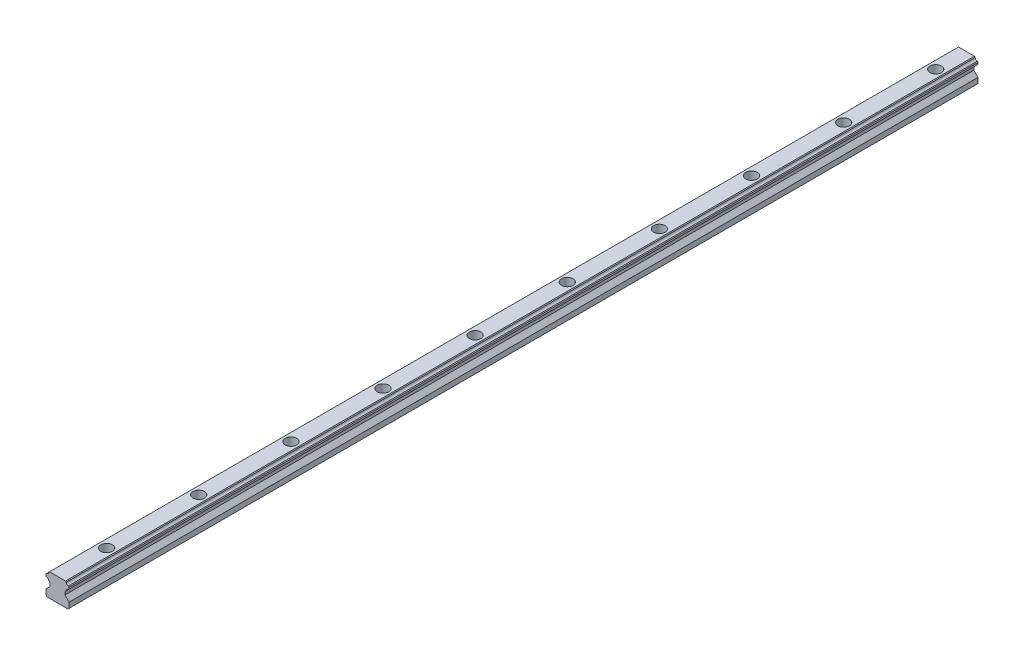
ISO-10303-21;
HEADER;
FILE_DESCRIPTION(('STEP AP214'),'2;1');
FILE_NAME('part.step','',(''),(''),'','','');
FILE_SCHEMA(('AUTOMOTIVE_DESIGN { 1 0 10303 214 1 1 1 1 }'));
ENDSEC;
DATA;
#1=APPLICATION_CONTEXT('core data for automotive mechanical design processes');
#2=APPLICATION_PROTOCOL_DEFINITION('international standard','automotive_design',2000,#1);
#3=PRODUCT_CONTEXT('',#1,'mechanical');
#4=PRODUCT('Part','Part','',(#3));
#5=PRODUCT_RELATED_PRODUCT_CATEGORY('part','',(#4));
#6=PRODUCT_DEFINITION_FORMATION('','',#4);
#7=PRODUCT_DEFINITION_CONTEXT('part definition',#1,'design');
#8=PRODUCT_DEFINITION('design','',#6,#7);
#9=PRODUCT_DEFINITION_SHAPE('','',#8);
#10=(LENGTH_UNIT() NAMED_UNIT(*) SI_UNIT(.MILLI.,.METRE.));
#11=(NAMED_UNIT(*) PLANE_ANGLE_UNIT() SI_UNIT($,.RADIAN.));
#12=(NAMED_UNIT(*) SI_UNIT($,.STERADIAN.) SOLID_ANGLE_UNIT());
#13=UNCERTAINTY_MEASURE_WITH_UNIT(LENGTH_MEASURE(1.E-05),#10,'distance_accuracy_value','');
#14=(GEOMETRIC_REPRESENTATION_CONTEXT(3) GLOBAL_UNCERTAINTY_ASSIGNED_CONTEXT((#13)) GLOBAL_UNIT_ASSIGNED_CONTEXT((#10,
#11,#12)) REPRESENTATION_CONTEXT('',''));
#15=CARTESIAN_POINT('',(0.,0.,0.));
#16=DIRECTION('',(0.,0.,1.));
#17=DIRECTION('',(1.,0.,0.));
#18=AXIS2_PLACEMENT_3D('',#15,#16,#17);
#19=CARTESIAN_POINT('',(2.44426124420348,15.0317972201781,592.));
#20=DIRECTION('',(0.,-1.,0.));
#21=DIRECTION('',(0.,0.,-1.));
#22=AXIS2_PLACEMENT_3D('',#19,#20,#21);
#23=PLANE('',#22);
#24=CARTESIAN_POINT('',(7.64426124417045,15.0317972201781,20.));
#25=DIRECTION('',(0.,1.,0.));
#26=DIRECTION('',(0.,0.,1.));
#27=AXIS2_PLACEMENT_3D('',#24,#25,#26);
#28=CIRCLE('',#27,3.74999999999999);
#29=CARTESIAN_POINT('',(7.64426124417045,15.0317972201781,23.75));
#30=VERTEX_POINT('',#29);
#31=EDGE_CURVE('E858',#30,#30,#28,.T.);
#32=ORIENTED_EDGE('',*,*,#31,.F.);
#33=EDGE_LOOP('',(#32));
#34=FACE_BOUND('',#33,.T.);
#35=CARTESIAN_POINT('',(7.64426124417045,15.0317972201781,80.));
#36=DIRECTION('',(0.,1.,0.));
#37=DIRECTION('',(0.,0.,1.));
#38=AXIS2_PLACEMENT_3D('',#35,#36,#37);
#39=CIRCLE('',#38,3.74999999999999);
#40=CARTESIAN_POINT('',(7.64426124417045,15.0317972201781,83.75));
#41=VERTEX_POINT('',#40);
#42=EDGE_CURVE('E868',#41,#41,#39,.T.);
#43=ORIENTED_EDGE('',*,*,#42,.F.);
#44=EDGE_LOOP('',(#43));
#45=FACE_BOUND('',#44,.T.);
#46=CARTESIAN_POINT('',(7.64426124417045,15.0317972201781,140.));
#47=DIRECTION('',(0.,1.,0.));
#48=DIRECTION('',(0.,0.,1.));
#49=AXIS2_PLACEMENT_3D('',#46,#47,#48);
#50=CIRCLE('',#49,3.74999999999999);
#51=CARTESIAN_POINT('',(7.64426124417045,15.0317972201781,143.75));
#52=VERTEX_POINT('',#51);
#53=EDGE_CURVE('E880',#52,#52,#50,.T.);
#54=ORIENTED_EDGE('',*,*,#53,.F.);
#55=EDGE_LOOP('',(#54));
#56=FACE_BOUND('',#55,.T.);
#57=CARTESIAN_POINT('',(7.64426124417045,15.0317972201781,200.));
#58=DIRECTION('',(0.,1.,0.));
#59=DIRECTION('',(0.,0.,1.));
#60=AXIS2_PLACEMENT_3D('',#57,#58,#59);
#61=CIRCLE('',#60,3.74999999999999);
#62=CARTESIAN_POINT('',(7.64426124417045,15.0317972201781,203.75));
#63=VERTEX_POINT('',#62);
#64=EDGE_CURVE('E892',#63,#63,#61,.T.);
#65=ORIENTED_EDGE('',*,*,#64,.F.);
#66=EDGE_LOOP('',(#65));
#67=FACE_BOUND('',#66,.T.);
#68=CARTESIAN_POINT('',(7.64426124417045,15.0317972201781,260.));
#69=DIRECTION('',(0.,1.,0.));
#70=DIRECTION('',(0.,0.,1.));
#71=AXIS2_PLACEMENT_3D('',#68,#69,#70);
#72=CIRCLE('',#71,3.74999999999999);
#73=CARTESIAN_POINT('',(7.64426124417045,15.0317972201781,263.75));
#74=VERTEX_POINT('',#73);
#75=EDGE_CURVE('E904',#74,#74,#72,.T.);
#76=ORIENTED_EDGE('',*,*,#75,.F.);
#77=EDGE_LOOP('',(#76));
#78=FACE_BOUND('',#77,.T.);
#79=CARTESIAN_POINT('',(7.64426124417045,15.0317972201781,320.));
#80=DIRECTION('',(0.,1.,0.));
#81=DIRECTION('',(0.,0.,1.));
#82=AXIS2_PLACEMENT_3D('',#79,#80,#81);
#83=CIRCLE('',#82,3.74999999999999);
#84=CARTESIAN_POINT('',(7.64426124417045,15.0317972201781,323.75));
#85=VERTEX_POINT('',#84);
#86=EDGE_CURVE('E916',#85,#85,#83,.T.);
#87=ORIENTED_EDGE('',*,*,#86,.F.);
#88=EDGE_LOOP('',(#87));
#89=FACE_BOUND('',#88,.T.);
#90=CARTESIAN_POINT('',(7.64426124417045,15.0317972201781,380.));
#91=DIRECTION('',(0.,1.,0.));
#92=DIRECTION('',(0.,0.,1.));
#93=AXIS2_PLACEMENT_3D('',#90,#91,#92);
#94=CIRCLE('',#93,3.74999999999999);
#95=CARTESIAN_POINT('',(7.64426124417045,15.0317972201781,383.75));
#96=VERTEX_POINT('',#95);
#97=EDGE_CURVE('E928',#96,#96,#94,.T.);
#98=ORIENTED_EDGE('',*,*,#97,.F.);
#99=EDGE_LOOP('',(#98));
#100=FACE_BOUND('',#99,.T.);
#101=CARTESIAN_POINT('',(7.64426124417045,15.0317972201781,440.));
#102=DIRECTION('',(0.,1.,0.));
#103=DIRECTION('',(0.,0.,1.));
#104=AXIS2_PLACEMENT_3D('',#101,#102,#103);
#105=CIRCLE('',#104,3.74999999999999);
#106=CARTESIAN_POINT('',(7.64426124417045,15.0317972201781,443.75));
#107=VERTEX_POINT('',#106);
#108=EDGE_CURVE('E940',#107,#107,#105,.T.);
#109=ORIENTED_EDGE('',*,*,#108,.F.);
#110=EDGE_LOOP('',(#109));
#111=FACE_BOUND('',#110,.T.);
#112=CARTESIAN_POINT('',(7.64426124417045,15.0317972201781,560.));
#113=DIRECTION('',(0.,1.,0.));
#114=DIRECTION('',(0.,0.,1.));
#115=AXIS2_PLACEMENT_3D('',#112,#113,#114);
#116=CIRCLE('',#115,3.74999999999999);
#117=CARTESIAN_POINT('',(7.64426124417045,15.0317972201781,563.75));
#118=VERTEX_POINT('',#117);
#119=EDGE_CURVE('E428',#118,#118,#116,.T.);
#120=ORIENTED_EDGE('',*,*,#119,.F.);
#121=EDGE_LOOP('',(#120));
#122=FACE_BOUND('',#121,.T.);
#123=DIRECTION('',(-1.,0.,0.));
#124=VECTOR('',#123,1.);
#125=CARTESIAN_POINT('',(2.44426124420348,15.0317972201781,0.));
#126=LINE('',#125,#124);
#127=CARTESIAN_POINT('',(12.8442612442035,15.0317972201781,0.));
#128=VERTEX_POINT('',#127);
#129=CARTESIAN_POINT('',(2.44426124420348,15.0317972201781,0.));
#130=VERTEX_POINT('',#129);
#131=EDGE_CURVE('E137',#128,#130,#126,.T.);
#132=ORIENTED_EDGE('',*,*,#131,.T.);
#133=DIRECTION('',(0.,0.,-1.));
#134=VECTOR('',#133,1.);
#135=CARTESIAN_POINT('',(2.44426124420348,15.0317972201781,592.));
#136=LINE('',#135,#134);
#137=CARTESIAN_POINT('',(2.44426124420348,15.0317972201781,592.));
#138=VERTEX_POINT('',#137);
#139=EDGE_CURVE('E226',#138,#130,#136,.T.);
#140=ORIENTED_EDGE('',*,*,#139,.F.);
#141=DIRECTION('',(-1.,0.,0.));
#142=VECTOR('',#141,1.);
#143=CARTESIAN_POINT('',(2.44426124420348,15.0317972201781,592.));
#144=LINE('',#143,#142);
#145=CARTESIAN_POINT('',(12.8442612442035,15.0317972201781,592.));
#146=VERTEX_POINT('',#145);
#147=EDGE_CURVE('E54',#146,#138,#144,.T.);
#148=ORIENTED_EDGE('',*,*,#147,.F.);
#149=DIRECTION('',(0.,0.,-1.));
#150=VECTOR('',#149,1.);
#151=CARTESIAN_POINT('',(12.8442612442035,15.0317972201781,592.));
#152=LINE('',#151,#150);
#153=EDGE_CURVE('E222',#146,#128,#152,.T.);
#154=ORIENTED_EDGE('',*,*,#153,.T.);
#155=EDGE_LOOP('',(#132,#140,#148,#154));
#156=FACE_BOUND('',#155,.T.);
#157=CARTESIAN_POINT('',(7.64426124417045,15.0317972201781,500.));
#158=DIRECTION('',(0.,1.,0.));
#159=DIRECTION('',(0.,0.,1.));
#160=AXIS2_PLACEMENT_3D('',#157,#158,#159);
#161=CIRCLE('',#160,3.74999999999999);
#162=CARTESIAN_POINT('',(7.64426124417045,15.0317972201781,503.75));
#163=VERTEX_POINT('',#162);
#164=EDGE_CURVE('E410',#163,#163,#161,.T.);
#165=ORIENTED_EDGE('',*,*,#164,.F.);
#166=EDGE_LOOP('',(#165));
#167=FACE_BOUND('',#166,.T.);
#168=ADVANCED_FACE('F37',(#34,#45,#56,#67,#78,#89,#100,#111,#122,#156,#167),#23,.F.);
#169=CARTESIAN_POINT('',(1.98646908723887,14.5740050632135,592.));
#170=DIRECTION('',(0.707106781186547,-0.707106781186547,0.));
#171=DIRECTION('',(0.707106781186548,0.707106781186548,0.));
#172=AXIS2_PLACEMENT_3D('',#169,#170,#171);
#173=PLANE('',#172);
#174=DIRECTION('',(-0.707106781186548,-0.707106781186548,0.));
#175=VECTOR('',#174,1.);
#176=CARTESIAN_POINT('',(1.98646908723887,14.5740050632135,0.));
#177=LINE('',#176,#175);
#178=CARTESIAN_POINT('',(1.98646908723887,14.5740050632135,0.));
#179=VERTEX_POINT('',#178);
#180=EDGE_CURVE('E230',#130,#179,#177,.T.);
#181=ORIENTED_EDGE('',*,*,#180,.T.);
#182=DIRECTION('',(0.,0.,-1.));
#183=VECTOR('',#182,1.);
#184=CARTESIAN_POINT('',(1.98646908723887,14.5740050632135,592.));
#185=LINE('',#184,#183);
#186=CARTESIAN_POINT('',(1.98646908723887,14.5740050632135,592.));
#187=VERTEX_POINT('',#186);
#188=EDGE_CURVE('E11',#187,#179,#185,.T.);
#189=ORIENTED_EDGE('',*,*,#188,.F.);
#190=DIRECTION('',(-0.707106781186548,-0.707106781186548,0.));
#191=VECTOR('',#190,1.);
#192=CARTESIAN_POINT('',(1.98646908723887,14.5740050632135,592.));
#193=LINE('',#192,#191);
#194=EDGE_CURVE('E277',#138,#187,#193,.T.);
#195=ORIENTED_EDGE('',*,*,#194,.F.);
#196=ORIENTED_EDGE('',*,*,#139,.T.);
#197=EDGE_LOOP('',(#181,#189,#195,#196));
#198=FACE_BOUND('',#197,.T.);
#199=ADVANCED_FACE('F39',(#198),#173,.F.);
#200=CARTESIAN_POINT('',(0.399359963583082,14.7766985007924,592.));
#201=DIRECTION('',(0.,0.,-1.));
#202=DIRECTION('',(-1.,0.,0.));
#203=AXIS2_PLACEMENT_3D('',#200,#201,#202);
#204=CYLINDRICAL_SURFACE('',#203,1.60000000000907);
#205=CARTESIAN_POINT('',(0.399359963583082,14.7766985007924,0.));
#206=DIRECTION('',(0.,0.,-1.));
#207=DIRECTION('',(1.,0.,0.));
#208=AXIS2_PLACEMENT_3D('',#205,#206,#207);
#209=CIRCLE('',#208,1.60000000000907);
#210=CARTESIAN_POINT('',(0.60205340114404,13.1895893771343,0.));
#211=VERTEX_POINT('',#210);
#212=EDGE_CURVE('E233',#179,#211,#209,.T.);
#213=ORIENTED_EDGE('',*,*,#212,.T.);
#214=DIRECTION('',(0.,0.,-1.));
#215=VECTOR('',#214,1.);
#216=CARTESIAN_POINT('',(0.60205340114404,13.1895893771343,592.));
#217=LINE('',#216,#215);
#218=CARTESIAN_POINT('',(0.60205340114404,13.1895893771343,592.));
#219=VERTEX_POINT('',#218);
#220=EDGE_CURVE('E46',#219,#211,#217,.T.);
#221=ORIENTED_EDGE('',*,*,#220,.F.);
#222=CARTESIAN_POINT('',(0.399359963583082,14.7766985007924,592.));
#223=DIRECTION('',(0.,0.,-1.));
#224=DIRECTION('',(1.,0.,0.));
#225=AXIS2_PLACEMENT_3D('',#222,#223,#224);
#226=CIRCLE('',#225,1.60000000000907);
#227=EDGE_CURVE('E145',#187,#219,#226,.T.);
#228=ORIENTED_EDGE('',*,*,#227,.F.);
#229=ORIENTED_EDGE('',*,*,#188,.T.);
#230=EDGE_LOOP('',(#213,#221,#228,#229));
#231=FACE_BOUND('',#230,.T.);
#232=ADVANCED_FACE('F544',(#231),#204,.F.);
#233=CARTESIAN_POINT('',(0.144261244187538,12.7317972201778,592.));
#234=DIRECTION('',(0.707106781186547,-0.707106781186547,0.));
#235=DIRECTION('',(0.707106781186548,0.707106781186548,0.));
#236=AXIS2_PLACEMENT_3D('',#233,#234,#235);
#237=PLANE('',#236);
#238=DIRECTION('',(-0.707106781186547,-0.707106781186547,0.));
#239=VECTOR('',#238,1.);
#240=CARTESIAN_POINT('',(0.144261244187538,12.7317972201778,0.));
#241=LINE('',#240,#239);
#242=CARTESIAN_POINT('',(0.144261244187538,12.7317972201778,0.));
#243=VERTEX_POINT('',#242);
#244=EDGE_CURVE('E236',#211,#243,#241,.T.);
#245=ORIENTED_EDGE('',*,*,#244,.T.);
#246=DIRECTION('',(0.,0.,-1.));
#247=VECTOR('',#246,1.);
#248=CARTESIAN_POINT('',(0.144261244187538,12.7317972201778,592.));
#249=LINE('',#248,#247);
#250=CARTESIAN_POINT('',(0.144261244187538,12.7317972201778,592.));
#251=VERTEX_POINT('',#250);
#252=EDGE_CURVE('E332',#251,#243,#249,.T.);
#253=ORIENTED_EDGE('',*,*,#252,.F.);
#254=DIRECTION('',(-0.707106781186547,-0.707106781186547,0.));
#255=VECTOR('',#254,1.);
#256=CARTESIAN_POINT('',(0.144261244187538,12.7317972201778,592.));
#257=LINE('',#256,#255);
#258=EDGE_CURVE('E340',#219,#251,#257,.T.);
#259=ORIENTED_EDGE('',*,*,#258,.F.);
#260=ORIENTED_EDGE('',*,*,#220,.T.);
#261=EDGE_LOOP('',(#245,#253,#259,#260));
#262=FACE_BOUND('',#261,.T.);
#263=ADVANCED_FACE('F338',(#262),#237,.F.);
#264=CARTESIAN_POINT('',(0.144261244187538,12.7317972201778,592.));
#265=DIRECTION('',(1.,0.,0.));
#266=DIRECTION('',(0.,0.,-1.));
#267=AXIS2_PLACEMENT_3D('',#264,#265,#266);
#268=PLANE('',#267);
#269=DIRECTION('',(0.,-1.,0.));
#270=VECTOR('',#269,1.);
#271=CARTESIAN_POINT('',(0.144261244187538,12.7317972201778,0.));
#272=LINE('',#271,#270);
#273=CARTESIAN_POINT('',(0.144261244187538,11.5317972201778,0.));
#274=VERTEX_POINT('',#273);
#275=EDGE_CURVE('E238',#243,#274,#272,.T.);
#276=ORIENTED_EDGE('',*,*,#275,.T.);
#277=DIRECTION('',(0.,0.,-1.));
#278=VECTOR('',#277,1.);
#279=CARTESIAN_POINT('',(0.144261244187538,11.5317972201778,592.));
#280=LINE('',#279,#278);
#281=CARTESIAN_POINT('',(0.144261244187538,11.5317972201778,592.));
#282=VERTEX_POINT('',#281);
#283=EDGE_CURVE('E329',#282,#274,#280,.T.);
#284=ORIENTED_EDGE('',*,*,#283,.F.);
#285=DIRECTION('',(0.,-1.,0.));
#286=VECTOR('',#285,1.);
#287=CARTESIAN_POINT('',(0.144261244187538,12.7317972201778,592.));
#288=LINE('',#287,#286);
#289=EDGE_CURVE('E358',#251,#282,#288,.T.);
#290=ORIENTED_EDGE('',*,*,#289,.F.);
#291=ORIENTED_EDGE('',*,*,#252,.T.);
#292=EDGE_LOOP('',(#276,#284,#290,#291));
#293=FACE_BOUND('',#292,.T.);
#294=ADVANCED_FACE('F349',(#293),#268,.F.);
#295=CARTESIAN_POINT('',(0.144261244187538,11.5317972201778,592.));
#296=DIRECTION('',(0.707106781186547,0.707106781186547,0.));
#297=DIRECTION('',(-0.707106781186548,0.707106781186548,0.));
#298=AXIS2_PLACEMENT_3D('',#295,#296,#297);
#299=PLANE('',#298);
#300=DIRECTION('',(0.707106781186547,-0.707106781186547,0.));
#301=VECTOR('',#300,1.);
#302=CARTESIAN_POINT('',(0.144261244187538,11.5317972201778,0.));
#303=LINE('',#302,#301);
#304=CARTESIAN_POINT('',(0.602053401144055,11.0740050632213,0.));
#305=VERTEX_POINT('',#304);
#306=EDGE_CURVE('E240',#274,#305,#303,.T.);
#307=ORIENTED_EDGE('',*,*,#306,.T.);
#308=DIRECTION('',(0.,0.,-1.));
#309=VECTOR('',#308,1.);
#310=CARTESIAN_POINT('',(0.602053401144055,11.0740050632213,592.));
#311=LINE('',#310,#309);
#312=CARTESIAN_POINT('',(0.602053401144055,11.0740050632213,592.));
#313=VERTEX_POINT('',#312);
#314=EDGE_CURVE('E326',#313,#305,#311,.T.);
#315=ORIENTED_EDGE('',*,*,#314,.F.);
#316=DIRECTION('',(0.707106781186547,-0.707106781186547,0.));
#317=VECTOR('',#316,1.);
#318=CARTESIAN_POINT('',(0.144261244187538,11.5317972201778,592.));
#319=LINE('',#318,#317);
#320=EDGE_CURVE('E355',#282,#313,#319,.T.);
#321=ORIENTED_EDGE('',*,*,#320,.F.);
#322=ORIENTED_EDGE('',*,*,#283,.T.);
#323=EDGE_LOOP('',(#307,#315,#321,#322));
#324=FACE_BOUND('',#323,.T.);
#325=ADVANCED_FACE('F353',(#324),#299,.F.);
#326=CARTESIAN_POINT('',(0.399359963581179,9.48689593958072,592.));
#327=DIRECTION('',(0.,0.,-1.));
#328=DIRECTION('',(-1.,0.,0.));
#329=AXIS2_PLACEMENT_3D('',#326,#327,#328);
#330=CYLINDRICAL_SURFACE('',#329,1.59999999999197);
#331=CARTESIAN_POINT('',(0.399359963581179,9.48689593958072,0.));
#332=DIRECTION('',(0.,0.,-1.));
#333=DIRECTION('',(1.,0.,0.));
#334=AXIS2_PLACEMENT_3D('',#331,#332,#333);
#335=CIRCLE('',#334,1.59999999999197);
#336=CARTESIAN_POINT('',(1.98646908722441,9.68958937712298,0.));
#337=VERTEX_POINT('',#336);
#338=EDGE_CURVE('E242',#305,#337,#335,.T.);
#339=ORIENTED_EDGE('',*,*,#338,.T.);
#340=DIRECTION('',(0.,0.,-1.));
#341=VECTOR('',#340,1.);
#342=CARTESIAN_POINT('',(1.98646908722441,9.68958937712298,592.));
#343=LINE('',#342,#341);
#344=CARTESIAN_POINT('',(1.98646908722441,9.68958937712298,592.));
#345=VERTEX_POINT('',#344);
#346=EDGE_CURVE('E323',#345,#337,#343,.T.);
#347=ORIENTED_EDGE('',*,*,#346,.F.);
#348=CARTESIAN_POINT('',(0.399359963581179,9.48689593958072,592.));
#349=DIRECTION('',(0.,0.,-1.));
#350=DIRECTION('',(1.,0.,0.));
#351=AXIS2_PLACEMENT_3D('',#348,#349,#350);
#352=CIRCLE('',#351,1.59999999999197);
#353=EDGE_CURVE('E357',#313,#345,#352,.T.);
#354=ORIENTED_EDGE('',*,*,#353,.F.);
#355=ORIENTED_EDGE('',*,*,#314,.T.);
#356=EDGE_LOOP('',(#339,#347,#354,#355));
#357=FACE_BOUND('',#356,.T.);
#358=ADVANCED_FACE('F534',(#357),#330,.F.);
#359=CARTESIAN_POINT('',(1.98646908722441,9.68958937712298,592.));
#360=DIRECTION('',(0.707106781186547,0.707106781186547,0.));
#361=DIRECTION('',(-0.707106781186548,0.707106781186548,0.));
#362=AXIS2_PLACEMENT_3D('',#359,#360,#361);
#363=PLANE('',#362);
#364=DIRECTION('',(0.707106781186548,-0.707106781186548,0.));
#365=VECTOR('',#364,1.);
#366=CARTESIAN_POINT('',(1.98646908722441,9.68958937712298,0.));
#367=LINE('',#366,#365);
#368=CARTESIAN_POINT('',(2.84426124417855,8.83179722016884,0.));
#369=VERTEX_POINT('',#368);
#370=EDGE_CURVE('E244',#337,#369,#367,.T.);
#371=ORIENTED_EDGE('',*,*,#370,.T.);
#372=DIRECTION('',(0.,0.,-1.));
#373=VECTOR('',#372,1.);
#374=CARTESIAN_POINT('',(2.84426124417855,8.83179722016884,592.));
#375=LINE('',#374,#373);
#376=CARTESIAN_POINT('',(2.84426124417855,8.83179722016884,592.));
#377=VERTEX_POINT('',#376);
#378=EDGE_CURVE('E320',#377,#369,#375,.T.);
#379=ORIENTED_EDGE('',*,*,#378,.F.);
#380=DIRECTION('',(0.707106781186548,-0.707106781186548,0.));
#381=VECTOR('',#380,1.);
#382=CARTESIAN_POINT('',(1.98646908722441,9.68958937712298,592.));
#383=LINE('',#382,#381);
#384=EDGE_CURVE('E360',#345,#377,#383,.T.);
#385=ORIENTED_EDGE('',*,*,#384,.F.);
#386=ORIENTED_EDGE('',*,*,#346,.T.);
#387=EDGE_LOOP('',(#371,#379,#385,#386));
#388=FACE_BOUND('',#387,.T.);
#389=ADVANCED_FACE('F530',(#388),#363,.F.);
#390=CARTESIAN_POINT('',(2.84426124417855,8.83179722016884,592.));
#391=DIRECTION('',(1.,0.,0.));
#392=DIRECTION('',(0.,0.,-1.));
#393=AXIS2_PLACEMENT_3D('',#390,#391,#392);
#394=PLANE('',#393);
#395=DIRECTION('',(0.,-1.,0.));
#396=VECTOR('',#395,1.);
#397=CARTESIAN_POINT('',(2.84426124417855,8.83179722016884,0.));
#398=LINE('',#397,#396);
#399=CARTESIAN_POINT('',(2.84426124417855,6.93179722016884,0.));
#400=VERTEX_POINT('',#399);
#401=EDGE_CURVE('E246',#369,#400,#398,.T.);
#402=ORIENTED_EDGE('',*,*,#401,.T.);
#403=DIRECTION('',(0.,0.,-1.));
#404=VECTOR('',#403,1.);
#405=CARTESIAN_POINT('',(2.84426124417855,6.93179722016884,592.));
#406=LINE('',#405,#404);
#407=CARTESIAN_POINT('',(2.84426124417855,6.93179722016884,592.));
#408=VERTEX_POINT('',#407);
#409=EDGE_CURVE('E317',#408,#400,#406,.T.);
#410=ORIENTED_EDGE('',*,*,#409,.F.);
#411=DIRECTION('',(0.,-1.,0.));
#412=VECTOR('',#411,1.);
#413=CARTESIAN_POINT('',(2.84426124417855,8.83179722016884,592.));
#414=LINE('',#413,#412);
#415=EDGE_CURVE('E366',#377,#408,#414,.T.);
#416=ORIENTED_EDGE('',*,*,#415,.F.);
#417=ORIENTED_EDGE('',*,*,#378,.T.);
#418=EDGE_LOOP('',(#402,#410,#416,#417));
#419=FACE_BOUND('',#418,.T.);
#420=ADVANCED_FACE('F526',(#419),#394,.F.);
#421=CARTESIAN_POINT('',(0.14426124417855,4.23179722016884,592.));
#422=DIRECTION('',(0.707106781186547,-0.707106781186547,0.));
#423=DIRECTION('',(0.707106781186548,0.707106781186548,0.));
#424=AXIS2_PLACEMENT_3D('',#421,#422,#423);
#425=PLANE('',#424);
#426=DIRECTION('',(-0.707106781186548,-0.707106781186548,0.));
#427=VECTOR('',#426,1.);
#428=CARTESIAN_POINT('',(0.14426124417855,4.23179722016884,0.));
#429=LINE('',#428,#427);
#430=CARTESIAN_POINT('',(0.14426124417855,4.23179722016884,0.));
#431=VERTEX_POINT('',#430);
#432=EDGE_CURVE('E248',#400,#431,#429,.T.);
#433=ORIENTED_EDGE('',*,*,#432,.T.);
#434=DIRECTION('',(0.,0.,-1.));
#435=VECTOR('',#434,1.);
#436=CARTESIAN_POINT('',(0.14426124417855,4.23179722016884,592.));
#437=LINE('',#436,#435);
#438=CARTESIAN_POINT('',(0.14426124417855,4.23179722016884,592.));
#439=VERTEX_POINT('',#438);
#440=EDGE_CURVE('E314',#439,#431,#437,.T.);
#441=ORIENTED_EDGE('',*,*,#440,.F.);
#442=DIRECTION('',(-0.707106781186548,-0.707106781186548,0.));
#443=VECTOR('',#442,1.);
#444=CARTESIAN_POINT('',(0.14426124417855,4.23179722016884,592.));
#445=LINE('',#444,#443);
#446=EDGE_CURVE('E368',#408,#439,#445,.T.);
#447=ORIENTED_EDGE('',*,*,#446,.F.);
#448=ORIENTED_EDGE('',*,*,#409,.T.);
#449=EDGE_LOOP('',(#433,#441,#447,#448));
#450=FACE_BOUND('',#449,.T.);
#451=ADVANCED_FACE('F522',(#450),#425,.F.);
#452=CARTESIAN_POINT('',(0.14426124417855,4.23179722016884,592.));
#453=DIRECTION('',(1.,0.,0.));
#454=DIRECTION('',(0.,0.,-1.));
#455=AXIS2_PLACEMENT_3D('',#452,#453,#454);
#456=PLANE('',#455);
#457=DIRECTION('',(0.,-1.,0.));
#458=VECTOR('',#457,1.);
#459=CARTESIAN_POINT('',(0.14426124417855,4.23179722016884,0.));
#460=LINE('',#459,#458);
#461=CARTESIAN_POINT('',(0.14426124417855,0.731797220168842,0.));
#462=VERTEX_POINT('',#461);
#463=EDGE_CURVE('E250',#431,#462,#460,.T.);
#464=ORIENTED_EDGE('',*,*,#463,.T.);
#465=DIRECTION('',(0.,0.,-1.));
#466=VECTOR('',#465,1.);
#467=CARTESIAN_POINT('',(0.14426124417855,0.731797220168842,592.));
#468=LINE('',#467,#466);
#469=CARTESIAN_POINT('',(0.14426124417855,0.731797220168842,592.));
#470=VERTEX_POINT('',#469);
#471=EDGE_CURVE('E311',#470,#462,#468,.T.);
#472=ORIENTED_EDGE('',*,*,#471,.F.);
#473=DIRECTION('',(0.,-1.,0.));
#474=VECTOR('',#473,1.);
#475=CARTESIAN_POINT('',(0.14426124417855,4.23179722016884,592.));
#476=LINE('',#475,#474);
#477=EDGE_CURVE('E370',#439,#470,#476,.T.);
#478=ORIENTED_EDGE('',*,*,#477,.F.);
#479=ORIENTED_EDGE('',*,*,#440,.T.);
#480=EDGE_LOOP('',(#464,#472,#478,#479));
#481=FACE_BOUND('',#480,.T.);
#482=ADVANCED_FACE('F518',(#481),#456,.F.);
#483=CARTESIAN_POINT('',(0.14426124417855,0.731797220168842,592.));
#484=DIRECTION('',(0.707106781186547,0.707106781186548,0.));
#485=DIRECTION('',(-0.707106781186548,0.707106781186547,0.));
#486=AXIS2_PLACEMENT_3D('',#483,#484,#485);
#487=PLANE('',#486);
#488=DIRECTION('',(0.707106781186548,-0.707106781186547,0.));
#489=VECTOR('',#488,1.);
#490=CARTESIAN_POINT('',(0.14426124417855,0.731797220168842,0.));
#491=LINE('',#490,#489);
#492=CARTESIAN_POINT('',(0.844261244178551,0.0317972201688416,0.));
#493=VERTEX_POINT('',#492);
#494=EDGE_CURVE('E252',#462,#493,#491,.T.);
#495=ORIENTED_EDGE('',*,*,#494,.T.);
#496=DIRECTION('',(0.,0.,-1.));
#497=VECTOR('',#496,1.);
#498=CARTESIAN_POINT('',(0.844261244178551,0.0317972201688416,592.));
#499=LINE('',#498,#497);
#500=CARTESIAN_POINT('',(0.844261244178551,0.0317972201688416,592.));
#501=VERTEX_POINT('',#500);
#502=EDGE_CURVE('E308',#501,#493,#499,.T.);
#503=ORIENTED_EDGE('',*,*,#502,.F.);
#504=DIRECTION('',(0.707106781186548,-0.707106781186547,0.));
#505=VECTOR('',#504,1.);
#506=CARTESIAN_POINT('',(0.14426124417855,0.731797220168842,592.));
#507=LINE('',#506,#505);
#508=EDGE_CURVE('E372',#470,#501,#507,.T.);
#509=ORIENTED_EDGE('',*,*,#508,.F.);
#510=ORIENTED_EDGE('',*,*,#471,.T.);
#511=EDGE_LOOP('',(#495,#503,#509,#510));
#512=FACE_BOUND('',#511,.T.);
#513=ADVANCED_FACE('F514',(#512),#487,.F.);
#514=CARTESIAN_POINT('',(0.844261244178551,0.0317972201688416,592.));
#515=DIRECTION('',(0.,1.,0.));
#516=DIRECTION('',(0.,0.,1.));
#517=AXIS2_PLACEMENT_3D('',#514,#515,#516);
#518=PLANE('',#517);
#519=CARTESIAN_POINT('',(7.64426124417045,0.0317972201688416,20.));
#520=DIRECTION('',(0.,1.,0.));
#521=DIRECTION('',(0.,0.,1.));
#522=AXIS2_PLACEMENT_3D('',#519,#520,#521);
#523=CIRCLE('',#522,2.25);
#524=CARTESIAN_POINT('',(7.64426124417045,0.0317972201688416,22.25));
#525=VERTEX_POINT('',#524);
#526=EDGE_CURVE('E865',#525,#525,#523,.T.);
#527=ORIENTED_EDGE('',*,*,#526,.T.);
#528=EDGE_LOOP('',(#527));
#529=FACE_BOUND('',#528,.T.);
#530=CARTESIAN_POINT('',(7.64426124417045,0.0317972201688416,80.));
#531=DIRECTION('',(0.,1.,0.));
#532=DIRECTION('',(0.,0.,1.));
#533=AXIS2_PLACEMENT_3D('',#530,#531,#532);
#534=CIRCLE('',#533,2.25);
#535=CARTESIAN_POINT('',(7.64426124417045,0.0317972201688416,82.25));
#536=VERTEX_POINT('',#535);
#537=EDGE_CURVE('E877',#536,#536,#534,.T.);
#538=ORIENTED_EDGE('',*,*,#537,.T.);
#539=EDGE_LOOP('',(#538));
#540=FACE_BOUND('',#539,.T.);
#541=CARTESIAN_POINT('',(7.64426124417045,0.0317972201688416,140.));
#542=DIRECTION('',(0.,1.,0.));
#543=DIRECTION('',(0.,0.,1.));
#544=AXIS2_PLACEMENT_3D('',#541,#542,#543);
#545=CIRCLE('',#544,2.25);
#546=CARTESIAN_POINT('',(7.64426124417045,0.0317972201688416,142.25));
#547=VERTEX_POINT('',#546);
#548=EDGE_CURVE('E889',#547,#547,#545,.T.);
#549=ORIENTED_EDGE('',*,*,#548,.T.);
#550=EDGE_LOOP('',(#549));
#551=FACE_BOUND('',#550,.T.);
#552=CARTESIAN_POINT('',(7.64426124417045,0.0317972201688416,200.));
#553=DIRECTION('',(0.,1.,0.));
#554=DIRECTION('',(0.,0.,1.));
#555=AXIS2_PLACEMENT_3D('',#552,#553,#554);
#556=CIRCLE('',#555,2.25);
#557=CARTESIAN_POINT('',(7.64426124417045,0.0317972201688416,202.25));
#558=VERTEX_POINT('',#557);
#559=EDGE_CURVE('E901',#558,#558,#556,.T.);
#560=ORIENTED_EDGE('',*,*,#559,.T.);
#561=EDGE_LOOP('',(#560));
#562=FACE_BOUND('',#561,.T.);
#563=CARTESIAN_POINT('',(7.64426124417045,0.0317972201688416,260.));
#564=DIRECTION('',(0.,1.,0.));
#565=DIRECTION('',(0.,0.,1.));
#566=AXIS2_PLACEMENT_3D('',#563,#564,#565);
#567=CIRCLE('',#566,2.25);
#568=CARTESIAN_POINT('',(7.64426124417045,0.0317972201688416,262.25));
#569=VERTEX_POINT('',#568);
#570=EDGE_CURVE('E913',#569,#569,#567,.T.);
#571=ORIENTED_EDGE('',*,*,#570,.T.);
#572=EDGE_LOOP('',(#571));
#573=FACE_BOUND('',#572,.T.);
#574=CARTESIAN_POINT('',(7.64426124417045,0.0317972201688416,320.));
#575=DIRECTION('',(0.,1.,0.));
#576=DIRECTION('',(0.,0.,1.));
#577=AXIS2_PLACEMENT_3D('',#574,#575,#576);
#578=CIRCLE('',#577,2.25);
#579=CARTESIAN_POINT('',(7.64426124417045,0.0317972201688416,322.25));
#580=VERTEX_POINT('',#579);
#581=EDGE_CURVE('E925',#580,#580,#578,.T.);
#582=ORIENTED_EDGE('',*,*,#581,.T.);
#583=EDGE_LOOP('',(#582));
#584=FACE_BOUND('',#583,.T.);
#585=CARTESIAN_POINT('',(7.64426124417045,0.0317972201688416,380.));
#586=DIRECTION('',(0.,1.,0.));
#587=DIRECTION('',(0.,0.,1.));
#588=AXIS2_PLACEMENT_3D('',#585,#586,#587);
#589=CIRCLE('',#588,2.25);
#590=CARTESIAN_POINT('',(7.64426124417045,0.0317972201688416,382.25));
#591=VERTEX_POINT('',#590);
#592=EDGE_CURVE('E937',#591,#591,#589,.T.);
#593=ORIENTED_EDGE('',*,*,#592,.T.);
#594=EDGE_LOOP('',(#593));
#595=FACE_BOUND('',#594,.T.);
#596=CARTESIAN_POINT('',(7.64426124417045,0.0317972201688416,440.));
#597=DIRECTION('',(0.,1.,0.));
#598=DIRECTION('',(0.,0.,1.));
#599=AXIS2_PLACEMENT_3D('',#596,#597,#598);
#600=CIRCLE('',#599,2.25);
#601=CARTESIAN_POINT('',(7.64426124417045,0.0317972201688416,442.25));
#602=VERTEX_POINT('',#601);
#603=EDGE_CURVE('E413',#602,#602,#600,.T.);
#604=ORIENTED_EDGE('',*,*,#603,.T.);
#605=EDGE_LOOP('',(#604));
#606=FACE_BOUND('',#605,.T.);
#607=CARTESIAN_POINT('',(7.64426124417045,0.0317972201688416,500.));
#608=DIRECTION('',(0.,1.,0.));
#609=DIRECTION('',(0.,0.,1.));
#610=AXIS2_PLACEMENT_3D('',#607,#608,#609);
#611=CIRCLE('',#610,2.25);
#612=CARTESIAN_POINT('',(7.64426124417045,0.0317972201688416,502.25));
#613=VERTEX_POINT('',#612);
#614=EDGE_CURVE('E425',#613,#613,#611,.T.);
#615=ORIENTED_EDGE('',*,*,#614,.T.);
#616=EDGE_LOOP('',(#615));
#617=FACE_BOUND('',#616,.T.);
#618=CARTESIAN_POINT('',(7.64426124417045,0.0317972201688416,560.));
#619=DIRECTION('',(0.,1.,0.));
#620=DIRECTION('',(0.,0.,1.));
#621=AXIS2_PLACEMENT_3D('',#618,#619,#620);
#622=CIRCLE('',#621,2.25);
#623=CARTESIAN_POINT('',(7.64426124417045,0.0317972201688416,562.25));
#624=VERTEX_POINT('',#623);
#625=EDGE_CURVE('E234',#624,#624,#622,.T.);
#626=ORIENTED_EDGE('',*,*,#625,.T.);
#627=EDGE_LOOP('',(#626));
#628=FACE_BOUND('',#627,.T.);
#629=DIRECTION('',(1.,0.,0.));
#630=VECTOR('',#629,1.);
#631=CARTESIAN_POINT('',(0.844261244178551,0.0317972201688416,0.));
#632=LINE('',#631,#630);
#633=CARTESIAN_POINT('',(14.4442612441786,0.0317972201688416,0.));
#634=VERTEX_POINT('',#633);
#635=EDGE_CURVE('E254',#493,#634,#632,.T.);
#636=ORIENTED_EDGE('',*,*,#635,.T.);
#637=DIRECTION('',(0.,0.,-1.));
#638=VECTOR('',#637,1.);
#639=CARTESIAN_POINT('',(14.4442612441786,0.0317972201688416,592.));
#640=LINE('',#639,#638);
#641=CARTESIAN_POINT('',(14.4442612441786,0.0317972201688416,592.));
#642=VERTEX_POINT('',#641);
#643=EDGE_CURVE('E305',#642,#634,#640,.T.);
#644=ORIENTED_EDGE('',*,*,#643,.F.);
#645=DIRECTION('',(1.,0.,0.));
#646=VECTOR('',#645,1.);
#647=CARTESIAN_POINT('',(0.844261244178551,0.0317972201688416,592.));
#648=LINE('',#647,#646);
#649=EDGE_CURVE('E374',#501,#642,#648,.T.);
#650=ORIENTED_EDGE('',*,*,#649,.F.);
#651=ORIENTED_EDGE('',*,*,#502,.T.);
#652=EDGE_LOOP('',(#636,#644,#650,#651));
#653=FACE_BOUND('',#652,.T.);
#654=ADVANCED_FACE('F442',(#529,#540,#551,#562,#573,#584,#595,#606,#617,#628,#653),#518,.F.);
#655=CARTESIAN_POINT('',(15.1442612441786,0.731797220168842,592.));
#656=DIRECTION('',(-0.707106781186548,0.707106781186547,0.));
#657=DIRECTION('',(-0.707106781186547,-0.707106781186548,0.));
#658=AXIS2_PLACEMENT_3D('',#655,#656,#657);
#659=PLANE('',#658);
#660=DIRECTION('',(0.707106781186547,0.707106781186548,0.));
#661=VECTOR('',#660,1.);
#662=CARTESIAN_POINT('',(15.1442612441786,0.731797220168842,0.));
#663=LINE('',#662,#661);
#664=CARTESIAN_POINT('',(15.1442612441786,0.731797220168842,0.));
#665=VERTEX_POINT('',#664);
#666=EDGE_CURVE('E256',#634,#665,#663,.T.);
#667=ORIENTED_EDGE('',*,*,#666,.T.);
#668=DIRECTION('',(0.,0.,-1.));
#669=VECTOR('',#668,1.);
#670=CARTESIAN_POINT('',(15.1442612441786,0.731797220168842,592.));
#671=LINE('',#670,#669);
#672=CARTESIAN_POINT('',(15.1442612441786,0.731797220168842,592.));
#673=VERTEX_POINT('',#672);
#674=EDGE_CURVE('E302',#673,#665,#671,.T.);
#675=ORIENTED_EDGE('',*,*,#674,.F.);
#676=DIRECTION('',(0.707106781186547,0.707106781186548,0.));
#677=VECTOR('',#676,1.);
#678=CARTESIAN_POINT('',(15.1442612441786,0.731797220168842,592.));
#679=LINE('',#678,#677);
#680=EDGE_CURVE('E376',#642,#673,#679,.T.);
#681=ORIENTED_EDGE('',*,*,#680,.F.);
#682=ORIENTED_EDGE('',*,*,#643,.T.);
#683=EDGE_LOOP('',(#667,#675,#681,#682));
#684=FACE_BOUND('',#683,.T.);
#685=ADVANCED_FACE('F507',(#684),#659,.F.);
#686=CARTESIAN_POINT('',(15.1442612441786,4.23179722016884,592.));
#687=DIRECTION('',(-1.,0.,0.));
#688=DIRECTION('',(0.,0.,1.));
#689=AXIS2_PLACEMENT_3D('',#686,#687,#688);
#690=PLANE('',#689);
#691=DIRECTION('',(0.,1.,0.));
#692=VECTOR('',#691,1.);
#693=CARTESIAN_POINT('',(15.1442612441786,4.23179722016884,0.));
#694=LINE('',#693,#692);
#695=CARTESIAN_POINT('',(15.1442612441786,4.23179722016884,0.));
#696=VERTEX_POINT('',#695);
#697=EDGE_CURVE('E258',#665,#696,#694,.T.);
#698=ORIENTED_EDGE('',*,*,#697,.T.);
#699=DIRECTION('',(0.,0.,-1.));
#700=VECTOR('',#699,1.);
#701=CARTESIAN_POINT('',(15.1442612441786,4.23179722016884,592.));
#702=LINE('',#701,#700);
#703=CARTESIAN_POINT('',(15.1442612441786,4.23179722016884,592.));
#704=VERTEX_POINT('',#703);
#705=EDGE_CURVE('E299',#704,#696,#702,.T.);
#706=ORIENTED_EDGE('',*,*,#705,.F.);
#707=DIRECTION('',(0.,1.,0.));
#708=VECTOR('',#707,1.);
#709=CARTESIAN_POINT('',(15.1442612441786,4.23179722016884,592.));
#710=LINE('',#709,#708);
#711=EDGE_CURVE('E378',#673,#704,#710,.T.);
#712=ORIENTED_EDGE('',*,*,#711,.F.);
#713=ORIENTED_EDGE('',*,*,#674,.T.);
#714=EDGE_LOOP('',(#698,#706,#712,#713));
#715=FACE_BOUND('',#714,.T.);
#716=ADVANCED_FACE('F503',(#715),#690,.F.);
#717=CARTESIAN_POINT('',(15.1442612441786,4.23179722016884,592.));
#718=DIRECTION('',(-0.707106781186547,-0.707106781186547,0.));
#719=DIRECTION('',(0.707106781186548,-0.707106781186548,0.));
#720=AXIS2_PLACEMENT_3D('',#717,#718,#719);
#721=PLANE('',#720);
#722=DIRECTION('',(-0.707106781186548,0.707106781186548,0.));
#723=VECTOR('',#722,1.);
#724=CARTESIAN_POINT('',(15.1442612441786,4.23179722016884,0.));
#725=LINE('',#724,#723);
#726=CARTESIAN_POINT('',(12.4442612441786,6.93179722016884,0.));
#727=VERTEX_POINT('',#726);
#728=EDGE_CURVE('E260',#696,#727,#725,.T.);
#729=ORIENTED_EDGE('',*,*,#728,.T.);
#730=DIRECTION('',(0.,0.,-1.));
#731=VECTOR('',#730,1.);
#732=CARTESIAN_POINT('',(12.4442612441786,6.93179722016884,592.));
#733=LINE('',#732,#731);
#734=CARTESIAN_POINT('',(12.4442612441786,6.93179722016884,592.));
#735=VERTEX_POINT('',#734);
#736=EDGE_CURVE('E296',#735,#727,#733,.T.);
#737=ORIENTED_EDGE('',*,*,#736,.F.);
#738=DIRECTION('',(-0.707106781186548,0.707106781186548,0.));
#739=VECTOR('',#738,1.);
#740=CARTESIAN_POINT('',(15.1442612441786,4.23179722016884,592.));
#741=LINE('',#740,#739);
#742=EDGE_CURVE('E380',#704,#735,#741,.T.);
#743=ORIENTED_EDGE('',*,*,#742,.F.);
#744=ORIENTED_EDGE('',*,*,#705,.T.);
#745=EDGE_LOOP('',(#729,#737,#743,#744));
#746=FACE_BOUND('',#745,.T.);
#747=ADVANCED_FACE('F499',(#746),#721,.F.);
#748=CARTESIAN_POINT('',(12.4442612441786,8.83179722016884,592.));
#749=DIRECTION('',(-1.,0.,0.));
#750=DIRECTION('',(0.,0.,1.));
#751=AXIS2_PLACEMENT_3D('',#748,#749,#750);
#752=PLANE('',#751);
#753=DIRECTION('',(0.,1.,0.));
#754=VECTOR('',#753,1.);
#755=CARTESIAN_POINT('',(12.4442612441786,8.83179722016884,0.));
#756=LINE('',#755,#754);
#757=CARTESIAN_POINT('',(12.4442612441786,8.83179722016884,0.));
#758=VERTEX_POINT('',#757);
#759=EDGE_CURVE('E262',#727,#758,#756,.T.);
#760=ORIENTED_EDGE('',*,*,#759,.T.);
#761=DIRECTION('',(0.,0.,-1.));
#762=VECTOR('',#761,1.);
#763=CARTESIAN_POINT('',(12.4442612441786,8.83179722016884,592.));
#764=LINE('',#763,#762);
#765=CARTESIAN_POINT('',(12.4442612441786,8.83179722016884,592.));
#766=VERTEX_POINT('',#765);
#767=EDGE_CURVE('E293',#766,#758,#764,.T.);
#768=ORIENTED_EDGE('',*,*,#767,.F.);
#769=DIRECTION('',(0.,1.,0.));
#770=VECTOR('',#769,1.);
#771=CARTESIAN_POINT('',(12.4442612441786,8.83179722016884,592.));
#772=LINE('',#771,#770);
#773=EDGE_CURVE('E382',#735,#766,#772,.T.);
#774=ORIENTED_EDGE('',*,*,#773,.F.);
#775=ORIENTED_EDGE('',*,*,#736,.T.);
#776=EDGE_LOOP('',(#760,#768,#774,#775));
#777=FACE_BOUND('',#776,.T.);
#778=ADVANCED_FACE('F495',(#777),#752,.F.);
#779=CARTESIAN_POINT('',(13.3020534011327,9.68958937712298,592.));
#780=DIRECTION('',(-0.707106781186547,0.707106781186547,0.));
#781=DIRECTION('',(-0.707106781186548,-0.707106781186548,0.));
#782=AXIS2_PLACEMENT_3D('',#779,#780,#781);
#783=PLANE('',#782);
#784=DIRECTION('',(0.707106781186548,0.707106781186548,0.));
#785=VECTOR('',#784,1.);
#786=CARTESIAN_POINT('',(13.3020534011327,9.68958937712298,0.));
#787=LINE('',#786,#785);
#788=CARTESIAN_POINT('',(13.3020534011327,9.68958937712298,0.));
#789=VERTEX_POINT('',#788);
#790=EDGE_CURVE('E264',#758,#789,#787,.T.);
#791=ORIENTED_EDGE('',*,*,#790,.T.);
#792=DIRECTION('',(0.,0.,-1.));
#793=VECTOR('',#792,1.);
#794=CARTESIAN_POINT('',(13.3020534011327,9.68958937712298,592.));
#795=LINE('',#794,#793);
#796=CARTESIAN_POINT('',(13.3020534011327,9.68958937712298,592.));
#797=VERTEX_POINT('',#796);
#798=EDGE_CURVE('E290',#797,#789,#795,.T.);
#799=ORIENTED_EDGE('',*,*,#798,.F.);
#800=DIRECTION('',(0.707106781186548,0.707106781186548,0.));
#801=VECTOR('',#800,1.);
#802=CARTESIAN_POINT('',(13.3020534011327,9.68958937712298,592.));
#803=LINE('',#802,#801);
#804=EDGE_CURVE('E384',#766,#797,#803,.T.);
#805=ORIENTED_EDGE('',*,*,#804,.F.);
#806=ORIENTED_EDGE('',*,*,#767,.T.);
#807=EDGE_LOOP('',(#791,#799,#805,#806));
#808=FACE_BOUND('',#807,.T.);
#809=ADVANCED_FACE('F491',(#808),#783,.F.);
#810=CARTESIAN_POINT('',(14.8891625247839,9.4868959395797,592.));
#811=DIRECTION('',(0.,0.,-1.));
#812=DIRECTION('',(-1.,0.,0.));
#813=AXIS2_PLACEMENT_3D('',#810,#811,#812);
#814=CYLINDRICAL_SURFACE('',#813,1.6);
#815=CARTESIAN_POINT('',(14.8891625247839,9.4868959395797,0.));
#816=DIRECTION('',(0.,0.,-1.));
#817=DIRECTION('',(1.,0.,0.));
#818=AXIS2_PLACEMENT_3D('',#815,#816,#817);
#819=CIRCLE('',#818,1.6);
#820=CARTESIAN_POINT('',(14.686469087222,11.0740050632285,0.));
#821=VERTEX_POINT('',#820);
#822=EDGE_CURVE('E266',#789,#821,#819,.T.);
#823=ORIENTED_EDGE('',*,*,#822,.T.);
#824=DIRECTION('',(0.,0.,-1.));
#825=VECTOR('',#824,1.);
#826=CARTESIAN_POINT('',(14.686469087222,11.0740050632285,592.));
#827=LINE('',#826,#825);
#828=CARTESIAN_POINT('',(14.686469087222,11.0740050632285,592.));
#829=VERTEX_POINT('',#828);
#830=EDGE_CURVE('E287',#829,#821,#827,.T.);
#831=ORIENTED_EDGE('',*,*,#830,.F.);
#832=CARTESIAN_POINT('',(14.8891625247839,9.4868959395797,592.));
#833=DIRECTION('',(0.,0.,-1.));
#834=DIRECTION('',(1.,0.,0.));
#835=AXIS2_PLACEMENT_3D('',#832,#833,#834);
#836=CIRCLE('',#835,1.6);
#837=EDGE_CURVE('E386',#797,#829,#836,.T.);
#838=ORIENTED_EDGE('',*,*,#837,.F.);
#839=ORIENTED_EDGE('',*,*,#798,.T.);
#840=EDGE_LOOP('',(#823,#831,#838,#839));
#841=FACE_BOUND('',#840,.T.);
#842=ADVANCED_FACE('F487',(#841),#814,.F.);
#843=CARTESIAN_POINT('',(15.1442612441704,11.5317972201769,592.));
#844=DIRECTION('',(-0.707106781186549,0.707106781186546,0.));
#845=DIRECTION('',(-0.707106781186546,-0.707106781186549,0.));
#846=AXIS2_PLACEMENT_3D('',#843,#844,#845);
#847=PLANE('',#846);
#848=DIRECTION('',(0.707106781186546,0.707106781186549,0.));
#849=VECTOR('',#848,1.);
#850=CARTESIAN_POINT('',(15.1442612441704,11.5317972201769,0.));
#851=LINE('',#850,#849);
#852=CARTESIAN_POINT('',(15.1442612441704,11.5317972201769,0.));
#853=VERTEX_POINT('',#852);
#854=EDGE_CURVE('E268',#821,#853,#851,.T.);
#855=ORIENTED_EDGE('',*,*,#854,.T.);
#856=DIRECTION('',(0.,0.,-1.));
#857=VECTOR('',#856,1.);
#858=CARTESIAN_POINT('',(15.1442612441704,11.5317972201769,592.));
#859=LINE('',#858,#857);
#860=CARTESIAN_POINT('',(15.1442612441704,11.5317972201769,592.));
#861=VERTEX_POINT('',#860);
#862=EDGE_CURVE('E284',#861,#853,#859,.T.);
#863=ORIENTED_EDGE('',*,*,#862,.F.);
#864=DIRECTION('',(0.707106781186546,0.707106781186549,0.));
#865=VECTOR('',#864,1.);
#866=CARTESIAN_POINT('',(15.1442612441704,11.5317972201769,592.));
#867=LINE('',#866,#865);
#868=EDGE_CURVE('E388',#829,#861,#867,.T.);
#869=ORIENTED_EDGE('',*,*,#868,.F.);
#870=ORIENTED_EDGE('',*,*,#830,.T.);
#871=EDGE_LOOP('',(#855,#863,#869,#870));
#872=FACE_BOUND('',#871,.T.);
#873=ADVANCED_FACE('F484',(#872),#847,.F.);
#874=CARTESIAN_POINT('',(15.1442612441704,12.731797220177,592.));
#875=DIRECTION('',(-1.,0.,0.));
#876=DIRECTION('',(0.,0.,1.));
#877=AXIS2_PLACEMENT_3D('',#874,#875,#876);
#878=PLANE('',#877);
#879=DIRECTION('',(0.,1.,0.));
#880=VECTOR('',#879,1.);
#881=CARTESIAN_POINT('',(15.1442612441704,12.731797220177,0.));
#882=LINE('',#881,#880);
#883=CARTESIAN_POINT('',(15.1442612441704,12.731797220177,0.));
#884=VERTEX_POINT('',#883);
#885=EDGE_CURVE('E270',#853,#884,#882,.T.);
#886=ORIENTED_EDGE('',*,*,#885,.T.);
#887=DIRECTION('',(0.,0.,-1.));
#888=VECTOR('',#887,1.);
#889=CARTESIAN_POINT('',(15.1442612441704,12.731797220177,592.));
#890=LINE('',#889,#888);
#891=CARTESIAN_POINT('',(15.1442612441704,12.731797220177,592.));
#892=VERTEX_POINT('',#891);
#893=EDGE_CURVE('E281',#892,#884,#890,.T.);
#894=ORIENTED_EDGE('',*,*,#893,.F.);
#895=DIRECTION('',(0.,1.,0.));
#896=VECTOR('',#895,1.);
#897=CARTESIAN_POINT('',(15.1442612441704,12.731797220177,592.));
#898=LINE('',#897,#896);
#899=EDGE_CURVE('E390',#861,#892,#898,.T.);
#900=ORIENTED_EDGE('',*,*,#899,.F.);
#901=ORIENTED_EDGE('',*,*,#862,.T.);
#902=EDGE_LOOP('',(#886,#894,#900,#901));
#903=FACE_BOUND('',#902,.T.);
#904=ADVANCED_FACE('F396',(#903),#878,.F.);
#905=CARTESIAN_POINT('',(15.1442612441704,12.731797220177,592.));
#906=DIRECTION('',(-0.707106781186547,-0.707106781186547,0.));
#907=DIRECTION('',(0.707106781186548,-0.707106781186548,0.));
#908=AXIS2_PLACEMENT_3D('',#905,#906,#907);
#909=PLANE('',#908);
#910=DIRECTION('',(-0.707106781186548,0.707106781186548,0.));
#911=VECTOR('',#910,1.);
#912=CARTESIAN_POINT('',(15.1442612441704,12.731797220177,0.));
#913=LINE('',#912,#911);
#914=CARTESIAN_POINT('',(14.6864690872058,13.1895893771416,0.));
#915=VERTEX_POINT('',#914);
#916=EDGE_CURVE('E272',#884,#915,#913,.T.);
#917=ORIENTED_EDGE('',*,*,#916,.T.);
#918=DIRECTION('',(0.,0.,-1.));
#919=VECTOR('',#918,1.);
#920=CARTESIAN_POINT('',(14.6864690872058,13.1895893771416,592.));
#921=LINE('',#920,#919);
#922=CARTESIAN_POINT('',(14.6864690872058,13.1895893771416,592.));
#923=VERTEX_POINT('',#922);
#924=EDGE_CURVE('E221',#923,#915,#921,.T.);
#925=ORIENTED_EDGE('',*,*,#924,.F.);
#926=DIRECTION('',(-0.707106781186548,0.707106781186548,0.));
#927=VECTOR('',#926,1.);
#928=CARTESIAN_POINT('',(15.1442612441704,12.731797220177,592.));
#929=LINE('',#928,#927);
#930=EDGE_CURVE('E212',#892,#923,#929,.T.);
#931=ORIENTED_EDGE('',*,*,#930,.F.);
#932=ORIENTED_EDGE('',*,*,#893,.T.);
#933=EDGE_LOOP('',(#917,#925,#931,#932));
#934=FACE_BOUND('',#933,.T.);
#935=ADVANCED_FACE('F400',(#934),#909,.F.);
#936=CARTESIAN_POINT('',(14.8891625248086,14.7766985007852,592.));
#937=DIRECTION('',(0.,0.,-1.));
#938=DIRECTION('',(-1.,0.,0.));
#939=AXIS2_PLACEMENT_3D('',#936,#937,#938);
#940=CYLINDRICAL_SURFACE('',#939,1.6);
#941=CARTESIAN_POINT('',(14.8891625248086,14.7766985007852,0.));
#942=DIRECTION('',(0.,0.,-1.));
#943=DIRECTION('',(1.,0.,0.));
#944=AXIS2_PLACEMENT_3D('',#941,#942,#943);
#945=CIRCLE('',#944,1.6);
#946=CARTESIAN_POINT('',(13.30205340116,14.5740050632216,0.));
#947=VERTEX_POINT('',#946);
#948=EDGE_CURVE('E220',#915,#947,#945,.T.);
#949=ORIENTED_EDGE('',*,*,#948,.T.);
#950=DIRECTION('',(0.,0.,-1.));
#951=VECTOR('',#950,1.);
#952=CARTESIAN_POINT('',(13.30205340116,14.5740050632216,592.));
#953=LINE('',#952,#951);
#954=CARTESIAN_POINT('',(13.30205340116,14.5740050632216,592.));
#955=VERTEX_POINT('',#954);
#956=EDGE_CURVE('E217',#955,#947,#953,.T.);
#957=ORIENTED_EDGE('',*,*,#956,.F.);
#958=CARTESIAN_POINT('',(14.8891625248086,14.7766985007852,592.));
#959=DIRECTION('',(0.,0.,-1.));
#960=DIRECTION('',(1.,0.,0.));
#961=AXIS2_PLACEMENT_3D('',#958,#959,#960);
#962=CIRCLE('',#961,1.6);
#963=EDGE_CURVE('E206',#923,#955,#962,.T.);
#964=ORIENTED_EDGE('',*,*,#963,.F.);
#965=ORIENTED_EDGE('',*,*,#924,.T.);
#966=EDGE_LOOP('',(#949,#957,#964,#965));
#967=FACE_BOUND('',#966,.T.);
#968=ADVANCED_FACE('F218',(#967),#940,.F.);
#969=CARTESIAN_POINT('',(13.30205340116,14.5740050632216,592.));
#970=DIRECTION('',(-0.707106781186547,-0.707106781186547,0.));
#971=DIRECTION('',(0.707106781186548,-0.707106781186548,0.));
#972=AXIS2_PLACEMENT_3D('',#969,#970,#971);
#973=PLANE('',#972);
#974=DIRECTION('',(-0.707106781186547,0.707106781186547,0.));
#975=VECTOR('',#974,1.);
#976=CARTESIAN_POINT('',(13.30205340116,14.5740050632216,0.));
#977=LINE('',#976,#975);
#978=EDGE_CURVE('E131',#947,#128,#977,.T.);
#979=ORIENTED_EDGE('',*,*,#978,.T.);
#980=ORIENTED_EDGE('',*,*,#153,.F.);
#981=DIRECTION('',(-0.707106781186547,0.707106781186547,0.));
#982=VECTOR('',#981,1.);
#983=CARTESIAN_POINT('',(13.30205340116,14.5740050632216,592.));
#984=LINE('',#983,#982);
#985=EDGE_CURVE('E210',#955,#146,#984,.T.);
#986=ORIENTED_EDGE('',*,*,#985,.F.);
#987=ORIENTED_EDGE('',*,*,#956,.T.);
#988=EDGE_LOOP('',(#979,#980,#986,#987));
#989=FACE_BOUND('',#988,.T.);
#990=ADVANCED_FACE('F224',(#989),#973,.F.);
#991=CARTESIAN_POINT('',(14.8891625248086,14.7766985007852,592.));
#992=DIRECTION('',(0.,0.,1.));
#993=DIRECTION('',(1.,0.,0.));
#994=AXIS2_PLACEMENT_3D('',#991,#992,#993);
#995=PLANE('',#994);
#996=ORIENTED_EDGE('',*,*,#194,.T.);
#997=ORIENTED_EDGE('',*,*,#227,.T.);
#998=ORIENTED_EDGE('',*,*,#258,.T.);
#999=ORIENTED_EDGE('',*,*,#289,.T.);
#1000=ORIENTED_EDGE('',*,*,#320,.T.);
#1001=ORIENTED_EDGE('',*,*,#353,.T.);
#1002=ORIENTED_EDGE('',*,*,#384,.T.);
#1003=ORIENTED_EDGE('',*,*,#415,.T.);
#1004=ORIENTED_EDGE('',*,*,#446,.T.);
#1005=ORIENTED_EDGE('',*,*,#477,.T.);
#1006=ORIENTED_EDGE('',*,*,#508,.T.);
#1007=ORIENTED_EDGE('',*,*,#649,.T.);
#1008=ORIENTED_EDGE('',*,*,#680,.T.);
#1009=ORIENTED_EDGE('',*,*,#711,.T.);
#1010=ORIENTED_EDGE('',*,*,#742,.T.);
#1011=ORIENTED_EDGE('',*,*,#773,.T.);
#1012=ORIENTED_EDGE('',*,*,#804,.T.);
#1013=ORIENTED_EDGE('',*,*,#837,.T.);
#1014=ORIENTED_EDGE('',*,*,#868,.T.);
#1015=ORIENTED_EDGE('',*,*,#899,.T.);
#1016=ORIENTED_EDGE('',*,*,#930,.T.);
#1017=ORIENTED_EDGE('',*,*,#963,.T.);
#1018=ORIENTED_EDGE('',*,*,#985,.T.);
#1019=ORIENTED_EDGE('',*,*,#147,.T.);
#1020=EDGE_LOOP('',(#996,#997,#998,#999,#1000,#1001,#1002,#1003,#1004,#1005,#1006,#1007,#1008,
#1009,#1010,#1011,#1012,#1013,#1014,#1015,#1016,#1017,#1018,#1019));
#1021=FACE_BOUND('',#1020,.T.);
#1022=ADVANCED_FACE('F208',(#1021),#995,.T.);
#1023=CARTESIAN_POINT('',(14.8891625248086,14.7766985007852,0.));
#1024=DIRECTION('',(0.,0.,1.));
#1025=DIRECTION('',(1.,0.,0.));
#1026=AXIS2_PLACEMENT_3D('',#1023,#1024,#1025);
#1027=PLANE('',#1026);
#1028=ORIENTED_EDGE('',*,*,#180,.F.);
#1029=ORIENTED_EDGE('',*,*,#131,.F.);
#1030=ORIENTED_EDGE('',*,*,#978,.F.);
#1031=ORIENTED_EDGE('',*,*,#948,.F.);
#1032=ORIENTED_EDGE('',*,*,#916,.F.);
#1033=ORIENTED_EDGE('',*,*,#885,.F.);
#1034=ORIENTED_EDGE('',*,*,#854,.F.);
#1035=ORIENTED_EDGE('',*,*,#822,.F.);
#1036=ORIENTED_EDGE('',*,*,#790,.F.);
#1037=ORIENTED_EDGE('',*,*,#759,.F.);
#1038=ORIENTED_EDGE('',*,*,#728,.F.);
#1039=ORIENTED_EDGE('',*,*,#697,.F.);
#1040=ORIENTED_EDGE('',*,*,#666,.F.);
#1041=ORIENTED_EDGE('',*,*,#635,.F.);
#1042=ORIENTED_EDGE('',*,*,#494,.F.);
#1043=ORIENTED_EDGE('',*,*,#463,.F.);
#1044=ORIENTED_EDGE('',*,*,#432,.F.);
#1045=ORIENTED_EDGE('',*,*,#401,.F.);
#1046=ORIENTED_EDGE('',*,*,#370,.F.);
#1047=ORIENTED_EDGE('',*,*,#338,.F.);
#1048=ORIENTED_EDGE('',*,*,#306,.F.);
#1049=ORIENTED_EDGE('',*,*,#275,.F.);
#1050=ORIENTED_EDGE('',*,*,#244,.F.);
#1051=ORIENTED_EDGE('',*,*,#212,.F.);
#1052=EDGE_LOOP('',(#1028,#1029,#1030,#1031,#1032,#1033,#1034,#1035,#1036,#1037,#1038,#1039,
#1040,#1041,#1042,#1043,#1044,#1045,#1046,#1047,#1048,#1049,#1050,#1051));
#1053=FACE_BOUND('',#1052,.T.);
#1054=ADVANCED_FACE('F344',(#1053),#1027,.F.);
#1055=CARTESIAN_POINT('',(7.64426124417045,15.0317972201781,560.));
#1056=DIRECTION('',(0.,1.,0.));
#1057=DIRECTION('',(0.,0.,1.));
#1058=AXIS2_PLACEMENT_3D('',#1055,#1056,#1057);
#1059=CYLINDRICAL_SURFACE('',#1058,2.25);
#1060=ORIENTED_EDGE('',*,*,#625,.F.);
#1061=EDGE_LOOP('',(#1060));
#1062=FACE_BOUND('',#1061,.T.);
#1063=CARTESIAN_POINT('',(7.64426124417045,9.7317972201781,560.));
#1064=DIRECTION('',(0.,1.,0.));
#1065=DIRECTION('',(0.,0.,1.));
#1066=AXIS2_PLACEMENT_3D('',#1063,#1064,#1065);
#1067=CIRCLE('',#1066,2.25);
#1068=CARTESIAN_POINT('',(7.64426124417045,9.7317972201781,562.25));
#1069=VERTEX_POINT('',#1068);
#1070=EDGE_CURVE('E434',#1069,#1069,#1067,.T.);
#1071=ORIENTED_EDGE('',*,*,#1070,.T.);
#1072=EDGE_LOOP('',(#1071));
#1073=FACE_BOUND('',#1072,.T.);
#1074=ADVANCED_FACE('F445',(#1062,#1073),#1059,.F.);
#1075=CARTESIAN_POINT('',(9.89426124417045,9.7317972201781,560.));
#1076=DIRECTION('',(0.,-1.,0.));
#1077=DIRECTION('',(0.,0.,-1.));
#1078=AXIS2_PLACEMENT_3D('',#1075,#1076,#1077);
#1079=PLANE('',#1078);
#1080=ORIENTED_EDGE('',*,*,#1070,.F.);
#1081=EDGE_LOOP('',(#1080));
#1082=FACE_BOUND('',#1081,.T.);
#1083=CARTESIAN_POINT('',(7.64426124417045,9.7317972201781,560.));
#1084=DIRECTION('',(0.,1.,0.));
#1085=DIRECTION('',(0.,0.,1.));
#1086=AXIS2_PLACEMENT_3D('',#1083,#1084,#1085);
#1087=CIRCLE('',#1086,3.75);
#1088=CARTESIAN_POINT('',(7.64426124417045,9.7317972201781,563.75));
#1089=VERTEX_POINT('',#1088);
#1090=EDGE_CURVE('E431',#1089,#1089,#1087,.T.);
#1091=ORIENTED_EDGE('',*,*,#1090,.T.);
#1092=EDGE_LOOP('',(#1091));
#1093=FACE_BOUND('',#1092,.T.);
#1094=ADVANCED_FACE('F448',(#1082,#1093),#1079,.F.);
#1095=CARTESIAN_POINT('',(7.64426124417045,15.0317972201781,560.));
#1096=DIRECTION('',(0.,1.,0.));
#1097=DIRECTION('',(0.,0.,1.));
#1098=AXIS2_PLACEMENT_3D('',#1095,#1096,#1097);
#1099=CYLINDRICAL_SURFACE('',#1098,3.74999999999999);
#1100=ORIENTED_EDGE('',*,*,#1090,.F.);
#1101=EDGE_LOOP('',(#1100));
#1102=FACE_BOUND('',#1101,.T.);
#1103=ORIENTED_EDGE('',*,*,#119,.T.);
#1104=EDGE_LOOP('',(#1103));
#1105=FACE_BOUND('',#1104,.T.);
#1106=ADVANCED_FACE('F454',(#1102,#1105),#1099,.F.);
#1107=CARTESIAN_POINT('',(7.64426124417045,15.0317972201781,500.));
#1108=DIRECTION('',(0.,1.,0.));
#1109=DIRECTION('',(0.,0.,1.));
#1110=AXIS2_PLACEMENT_3D('',#1107,#1108,#1109);
#1111=CYLINDRICAL_SURFACE('',#1110,2.25);
#1112=ORIENTED_EDGE('',*,*,#614,.F.);
#1113=EDGE_LOOP('',(#1112));
#1114=FACE_BOUND('',#1113,.T.);
#1115=CARTESIAN_POINT('',(7.64426124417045,9.7317972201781,500.));
#1116=DIRECTION('',(0.,1.,0.));
#1117=DIRECTION('',(0.,0.,1.));
#1118=AXIS2_PLACEMENT_3D('',#1115,#1116,#1117);
#1119=CIRCLE('',#1118,2.25);
#1120=CARTESIAN_POINT('',(7.64426124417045,9.7317972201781,502.25));
#1121=VERTEX_POINT('',#1120);
#1122=EDGE_CURVE('E416',#1121,#1121,#1119,.T.);
#1123=ORIENTED_EDGE('',*,*,#1122,.T.);
#1124=EDGE_LOOP('',(#1123));
#1125=FACE_BOUND('',#1124,.T.);
#1126=ADVANCED_FACE('F460',(#1114,#1125),#1111,.F.);
#1127=CARTESIAN_POINT('',(9.89426124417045,9.7317972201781,500.));
#1128=DIRECTION('',(0.,-1.,0.));
#1129=DIRECTION('',(0.,0.,-1.));
#1130=AXIS2_PLACEMENT_3D('',#1127,#1128,#1129);
#1131=PLANE('',#1130);
#1132=ORIENTED_EDGE('',*,*,#1122,.F.);
#1133=EDGE_LOOP('',(#1132));
#1134=FACE_BOUND('',#1133,.T.);
#1135=CARTESIAN_POINT('',(7.64426124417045,9.7317972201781,500.));
#1136=DIRECTION('',(0.,1.,0.));
#1137=DIRECTION('',(0.,0.,1.));
#1138=AXIS2_PLACEMENT_3D('',#1135,#1136,#1137);
#1139=CIRCLE('',#1138,3.75);
#1140=CARTESIAN_POINT('',(7.64426124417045,9.7317972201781,503.75));
#1141=VERTEX_POINT('',#1140);
#1142=EDGE_CURVE('E412',#1141,#1141,#1139,.T.);
#1143=ORIENTED_EDGE('',*,*,#1142,.T.);
#1144=EDGE_LOOP('',(#1143));
#1145=FACE_BOUND('',#1144,.T.);
#1146=ADVANCED_FACE('F467',(#1134,#1145),#1131,.F.);
#1147=CARTESIAN_POINT('',(7.64426124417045,15.0317972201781,500.));
#1148=DIRECTION('',(0.,1.,0.));
#1149=DIRECTION('',(0.,0.,1.));
#1150=AXIS2_PLACEMENT_3D('',#1147,#1148,#1149);
#1151=CYLINDRICAL_SURFACE('',#1150,3.74999999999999);
#1152=ORIENTED_EDGE('',*,*,#1142,.F.);
#1153=EDGE_LOOP('',(#1152));
#1154=FACE_BOUND('',#1153,.T.);
#1155=ORIENTED_EDGE('',*,*,#164,.T.);
#1156=EDGE_LOOP('',(#1155));
#1157=FACE_BOUND('',#1156,.T.);
#1158=ADVANCED_FACE('F599',(#1154,#1157),#1151,.F.);
#1159=CARTESIAN_POINT('',(7.64426124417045,15.0317972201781,440.));
#1160=DIRECTION('',(0.,1.,0.));
#1161=DIRECTION('',(0.,0.,1.));
#1162=AXIS2_PLACEMENT_3D('',#1159,#1160,#1161);
#1163=CYLINDRICAL_SURFACE('',#1162,2.25);
#1164=ORIENTED_EDGE('',*,*,#603,.F.);
#1165=EDGE_LOOP('',(#1164));
#1166=FACE_BOUND('',#1165,.T.);
#1167=CARTESIAN_POINT('',(7.64426124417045,9.7317972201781,440.));
#1168=DIRECTION('',(0.,1.,0.));
#1169=DIRECTION('',(0.,0.,1.));
#1170=AXIS2_PLACEMENT_3D('',#1167,#1168,#1169);
#1171=CIRCLE('',#1170,2.25);
#1172=CARTESIAN_POINT('',(7.64426124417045,9.7317972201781,442.25));
#1173=VERTEX_POINT('',#1172);
#1174=EDGE_CURVE('E419',#1173,#1173,#1171,.T.);
#1175=ORIENTED_EDGE('',*,*,#1174,.T.);
#1176=EDGE_LOOP('',(#1175));
#1177=FACE_BOUND('',#1176,.T.);
#1178=ADVANCED_FACE('F608',(#1166,#1177),#1163,.F.);
#1179=CARTESIAN_POINT('',(9.89426124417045,9.7317972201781,440.));
#1180=DIRECTION('',(0.,-1.,0.));
#1181=DIRECTION('',(0.,0.,-1.));
#1182=AXIS2_PLACEMENT_3D('',#1179,#1180,#1181);
#1183=PLANE('',#1182);
#1184=ORIENTED_EDGE('',*,*,#1174,.F.);
#1185=EDGE_LOOP('',(#1184));
#1186=FACE_BOUND('',#1185,.T.);
#1187=CARTESIAN_POINT('',(7.64426124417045,9.7317972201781,440.));
#1188=DIRECTION('',(0.,1.,0.));
#1189=DIRECTION('',(0.,0.,1.));
#1190=AXIS2_PLACEMENT_3D('',#1187,#1188,#1189);
#1191=CIRCLE('',#1190,3.75);
#1192=CARTESIAN_POINT('',(7.64426124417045,9.7317972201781,443.75));
#1193=VERTEX_POINT('',#1192);
#1194=EDGE_CURVE('E943',#1193,#1193,#1191,.T.);
#1195=ORIENTED_EDGE('',*,*,#1194,.T.);
#1196=EDGE_LOOP('',(#1195));
#1197=FACE_BOUND('',#1196,.T.);
#1198=ADVANCED_FACE('F618',(#1186,#1197),#1183,.F.);
#1199=CARTESIAN_POINT('',(7.64426124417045,15.0317972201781,440.));
#1200=DIRECTION('',(0.,1.,0.));
#1201=DIRECTION('',(0.,0.,1.));
#1202=AXIS2_PLACEMENT_3D('',#1199,#1200,#1201);
#1203=CYLINDRICAL_SURFACE('',#1202,3.74999999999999);
#1204=ORIENTED_EDGE('',*,*,#1194,.F.);
#1205=EDGE_LOOP('',(#1204));
#1206=FACE_BOUND('',#1205,.T.);
#1207=ORIENTED_EDGE('',*,*,#108,.T.);
#1208=EDGE_LOOP('',(#1207));
#1209=FACE_BOUND('',#1208,.T.);
#1210=ADVANCED_FACE('F628',(#1206,#1209),#1203,.F.);
#1211=CARTESIAN_POINT('',(7.64426124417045,15.0317972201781,380.));
#1212=DIRECTION('',(0.,1.,0.));
#1213=DIRECTION('',(0.,0.,1.));
#1214=AXIS2_PLACEMENT_3D('',#1211,#1212,#1213);
#1215=CYLINDRICAL_SURFACE('',#1214,2.25);
#1216=ORIENTED_EDGE('',*,*,#592,.F.);
#1217=EDGE_LOOP('',(#1216));
#1218=FACE_BOUND('',#1217,.T.);
#1219=CARTESIAN_POINT('',(7.64426124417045,9.7317972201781,380.));
#1220=DIRECTION('',(0.,1.,0.));
#1221=DIRECTION('',(0.,0.,1.));
#1222=AXIS2_PLACEMENT_3D('',#1219,#1220,#1221);
#1223=CIRCLE('',#1222,2.25);
#1224=CARTESIAN_POINT('',(7.64426124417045,9.7317972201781,382.25));
#1225=VERTEX_POINT('',#1224);
#1226=EDGE_CURVE('E934',#1225,#1225,#1223,.T.);
#1227=ORIENTED_EDGE('',*,*,#1226,.T.);
#1228=EDGE_LOOP('',(#1227));
#1229=FACE_BOUND('',#1228,.T.);
#1230=ADVANCED_FACE('F638',(#1218,#1229),#1215,.F.);
#1231=CARTESIAN_POINT('',(9.89426124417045,9.7317972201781,380.));
#1232=DIRECTION('',(0.,-1.,0.));
#1233=DIRECTION('',(0.,0.,-1.));
#1234=AXIS2_PLACEMENT_3D('',#1231,#1232,#1233);
#1235=PLANE('',#1234);
#1236=ORIENTED_EDGE('',*,*,#1226,.F.);
#1237=EDGE_LOOP('',(#1236));
#1238=FACE_BOUND('',#1237,.T.);
#1239=CARTESIAN_POINT('',(7.64426124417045,9.7317972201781,380.));
#1240=DIRECTION('',(0.,1.,0.));
#1241=DIRECTION('',(0.,0.,1.));
#1242=AXIS2_PLACEMENT_3D('',#1239,#1240,#1241);
#1243=CIRCLE('',#1242,3.75);
#1244=CARTESIAN_POINT('',(7.64426124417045,9.7317972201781,383.75));
#1245=VERTEX_POINT('',#1244);
#1246=EDGE_CURVE('E931',#1245,#1245,#1243,.T.);
#1247=ORIENTED_EDGE('',*,*,#1246,.T.);
#1248=EDGE_LOOP('',(#1247));
#1249=FACE_BOUND('',#1248,.T.);
#1250=ADVANCED_FACE('F648',(#1238,#1249),#1235,.F.);
#1251=CARTESIAN_POINT('',(7.64426124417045,15.0317972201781,380.));
#1252=DIRECTION('',(0.,1.,0.));
#1253=DIRECTION('',(0.,0.,1.));
#1254=AXIS2_PLACEMENT_3D('',#1251,#1252,#1253);
#1255=CYLINDRICAL_SURFACE('',#1254,3.74999999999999);
#1256=ORIENTED_EDGE('',*,*,#1246,.F.);
#1257=EDGE_LOOP('',(#1256));
#1258=FACE_BOUND('',#1257,.T.);
#1259=ORIENTED_EDGE('',*,*,#97,.T.);
#1260=EDGE_LOOP('',(#1259));
#1261=FACE_BOUND('',#1260,.T.);
#1262=ADVANCED_FACE('F658',(#1258,#1261),#1255,.F.);
#1263=CARTESIAN_POINT('',(7.64426124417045,15.0317972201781,320.));
#1264=DIRECTION('',(0.,1.,0.));
#1265=DIRECTION('',(0.,0.,1.));
#1266=AXIS2_PLACEMENT_3D('',#1263,#1264,#1265);
#1267=CYLINDRICAL_SURFACE('',#1266,2.25);
#1268=ORIENTED_EDGE('',*,*,#581,.F.);
#1269=EDGE_LOOP('',(#1268));
#1270=FACE_BOUND('',#1269,.T.);
#1271=CARTESIAN_POINT('',(7.64426124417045,9.7317972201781,320.));
#1272=DIRECTION('',(0.,1.,0.));
#1273=DIRECTION('',(0.,0.,1.));
#1274=AXIS2_PLACEMENT_3D('',#1271,#1272,#1273);
#1275=CIRCLE('',#1274,2.25);
#1276=CARTESIAN_POINT('',(7.64426124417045,9.7317972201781,322.25));
#1277=VERTEX_POINT('',#1276);
#1278=EDGE_CURVE('E922',#1277,#1277,#1275,.T.);
#1279=ORIENTED_EDGE('',*,*,#1278,.T.);
#1280=EDGE_LOOP('',(#1279));
#1281=FACE_BOUND('',#1280,.T.);
#1282=ADVANCED_FACE('F668',(#1270,#1281),#1267,.F.);
#1283=CARTESIAN_POINT('',(9.89426124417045,9.7317972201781,320.));
#1284=DIRECTION('',(0.,-1.,0.));
#1285=DIRECTION('',(0.,0.,-1.));
#1286=AXIS2_PLACEMENT_3D('',#1283,#1284,#1285);
#1287=PLANE('',#1286);
#1288=ORIENTED_EDGE('',*,*,#1278,.F.);
#1289=EDGE_LOOP('',(#1288));
#1290=FACE_BOUND('',#1289,.T.);
#1291=CARTESIAN_POINT('',(7.64426124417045,9.7317972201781,320.));
#1292=DIRECTION('',(0.,1.,0.));
#1293=DIRECTION('',(0.,0.,1.));
#1294=AXIS2_PLACEMENT_3D('',#1291,#1292,#1293);
#1295=CIRCLE('',#1294,3.75);
#1296=CARTESIAN_POINT('',(7.64426124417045,9.7317972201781,323.75));
#1297=VERTEX_POINT('',#1296);
#1298=EDGE_CURVE('E919',#1297,#1297,#1295,.T.);
#1299=ORIENTED_EDGE('',*,*,#1298,.T.);
#1300=EDGE_LOOP('',(#1299));
#1301=FACE_BOUND('',#1300,.T.);
#1302=ADVANCED_FACE('F678',(#1290,#1301),#1287,.F.);
#1303=CARTESIAN_POINT('',(7.64426124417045,15.0317972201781,320.));
#1304=DIRECTION('',(0.,1.,0.));
#1305=DIRECTION('',(0.,0.,1.));
#1306=AXIS2_PLACEMENT_3D('',#1303,#1304,#1305);
#1307=CYLINDRICAL_SURFACE('',#1306,3.74999999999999);
#1308=ORIENTED_EDGE('',*,*,#1298,.F.);
#1309=EDGE_LOOP('',(#1308));
#1310=FACE_BOUND('',#1309,.T.);
#1311=ORIENTED_EDGE('',*,*,#86,.T.);
#1312=EDGE_LOOP('',(#1311));
#1313=FACE_BOUND('',#1312,.T.);
#1314=ADVANCED_FACE('F688',(#1310,#1313),#1307,.F.);
#1315=CARTESIAN_POINT('',(7.64426124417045,15.0317972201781,260.));
#1316=DIRECTION('',(0.,1.,0.));
#1317=DIRECTION('',(0.,0.,1.));
#1318=AXIS2_PLACEMENT_3D('',#1315,#1316,#1317);
#1319=CYLINDRICAL_SURFACE('',#1318,2.25);
#1320=ORIENTED_EDGE('',*,*,#570,.F.);
#1321=EDGE_LOOP('',(#1320));
#1322=FACE_BOUND('',#1321,.T.);
#1323=CARTESIAN_POINT('',(7.64426124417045,9.7317972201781,260.));
#1324=DIRECTION('',(0.,1.,0.));
#1325=DIRECTION('',(0.,0.,1.));
#1326=AXIS2_PLACEMENT_3D('',#1323,#1324,#1325);
#1327=CIRCLE('',#1326,2.25);
#1328=CARTESIAN_POINT('',(7.64426124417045,9.7317972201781,262.25));
#1329=VERTEX_POINT('',#1328);
#1330=EDGE_CURVE('E910',#1329,#1329,#1327,.T.);
#1331=ORIENTED_EDGE('',*,*,#1330,.T.);
#1332=EDGE_LOOP('',(#1331));
#1333=FACE_BOUND('',#1332,.T.);
#1334=ADVANCED_FACE('F698',(#1322,#1333),#1319,.F.);
#1335=CARTESIAN_POINT('',(9.89426124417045,9.7317972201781,260.));
#1336=DIRECTION('',(0.,-1.,0.));
#1337=DIRECTION('',(0.,0.,-1.));
#1338=AXIS2_PLACEMENT_3D('',#1335,#1336,#1337);
#1339=PLANE('',#1338);
#1340=ORIENTED_EDGE('',*,*,#1330,.F.);
#1341=EDGE_LOOP('',(#1340));
#1342=FACE_BOUND('',#1341,.T.);
#1343=CARTESIAN_POINT('',(7.64426124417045,9.7317972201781,260.));
#1344=DIRECTION('',(0.,1.,0.));
#1345=DIRECTION('',(0.,0.,1.));
#1346=AXIS2_PLACEMENT_3D('',#1343,#1344,#1345);
#1347=CIRCLE('',#1346,3.75);
#1348=CARTESIAN_POINT('',(7.64426124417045,9.7317972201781,263.75));
#1349=VERTEX_POINT('',#1348);
#1350=EDGE_CURVE('E907',#1349,#1349,#1347,.T.);
#1351=ORIENTED_EDGE('',*,*,#1350,.T.);
#1352=EDGE_LOOP('',(#1351));
#1353=FACE_BOUND('',#1352,.T.);
#1354=ADVANCED_FACE('F708',(#1342,#1353),#1339,.F.);
#1355=CARTESIAN_POINT('',(7.64426124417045,15.0317972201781,260.));
#1356=DIRECTION('',(0.,1.,0.));
#1357=DIRECTION('',(0.,0.,1.));
#1358=AXIS2_PLACEMENT_3D('',#1355,#1356,#1357);
#1359=CYLINDRICAL_SURFACE('',#1358,3.74999999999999);
#1360=ORIENTED_EDGE('',*,*,#1350,.F.);
#1361=EDGE_LOOP('',(#1360));
#1362=FACE_BOUND('',#1361,.T.);
#1363=ORIENTED_EDGE('',*,*,#75,.T.);
#1364=EDGE_LOOP('',(#1363));
#1365=FACE_BOUND('',#1364,.T.);
#1366=ADVANCED_FACE('F718',(#1362,#1365),#1359,.F.);
#1367=CARTESIAN_POINT('',(7.64426124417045,15.0317972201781,200.));
#1368=DIRECTION('',(0.,1.,0.));
#1369=DIRECTION('',(0.,0.,1.));
#1370=AXIS2_PLACEMENT_3D('',#1367,#1368,#1369);
#1371=CYLINDRICAL_SURFACE('',#1370,2.25);
#1372=ORIENTED_EDGE('',*,*,#559,.F.);
#1373=EDGE_LOOP('',(#1372));
#1374=FACE_BOUND('',#1373,.T.);
#1375=CARTESIAN_POINT('',(7.64426124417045,9.7317972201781,200.));
#1376=DIRECTION('',(0.,1.,0.));
#1377=DIRECTION('',(0.,0.,1.));
#1378=AXIS2_PLACEMENT_3D('',#1375,#1376,#1377);
#1379=CIRCLE('',#1378,2.25);
#1380=CARTESIAN_POINT('',(7.64426124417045,9.7317972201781,202.25));
#1381=VERTEX_POINT('',#1380);
#1382=EDGE_CURVE('E898',#1381,#1381,#1379,.T.);
#1383=ORIENTED_EDGE('',*,*,#1382,.T.);
#1384=EDGE_LOOP('',(#1383));
#1385=FACE_BOUND('',#1384,.T.);
#1386=ADVANCED_FACE('F728',(#1374,#1385),#1371,.F.);
#1387=CARTESIAN_POINT('',(9.89426124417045,9.7317972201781,200.));
#1388=DIRECTION('',(0.,-1.,0.));
#1389=DIRECTION('',(0.,0.,-1.));
#1390=AXIS2_PLACEMENT_3D('',#1387,#1388,#1389);
#1391=PLANE('',#1390);
#1392=ORIENTED_EDGE('',*,*,#1382,.F.);
#1393=EDGE_LOOP('',(#1392));
#1394=FACE_BOUND('',#1393,.T.);
#1395=CARTESIAN_POINT('',(7.64426124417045,9.7317972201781,200.));
#1396=DIRECTION('',(0.,1.,0.));
#1397=DIRECTION('',(0.,0.,1.));
#1398=AXIS2_PLACEMENT_3D('',#1395,#1396,#1397);
#1399=CIRCLE('',#1398,3.75);
#1400=CARTESIAN_POINT('',(7.64426124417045,9.7317972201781,203.75));
#1401=VERTEX_POINT('',#1400);
#1402=EDGE_CURVE('E895',#1401,#1401,#1399,.T.);
#1403=ORIENTED_EDGE('',*,*,#1402,.T.);
#1404=EDGE_LOOP('',(#1403));
#1405=FACE_BOUND('',#1404,.T.);
#1406=ADVANCED_FACE('F738',(#1394,#1405),#1391,.F.);
#1407=CARTESIAN_POINT('',(7.64426124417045,15.0317972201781,200.));
#1408=DIRECTION('',(0.,1.,0.));
#1409=DIRECTION('',(0.,0.,1.));
#1410=AXIS2_PLACEMENT_3D('',#1407,#1408,#1409);
#1411=CYLINDRICAL_SURFACE('',#1410,3.74999999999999);
#1412=ORIENTED_EDGE('',*,*,#1402,.F.);
#1413=EDGE_LOOP('',(#1412));
#1414=FACE_BOUND('',#1413,.T.);
#1415=ORIENTED_EDGE('',*,*,#64,.T.);
#1416=EDGE_LOOP('',(#1415));
#1417=FACE_BOUND('',#1416,.T.);
#1418=ADVANCED_FACE('F748',(#1414,#1417),#1411,.F.);
#1419=CARTESIAN_POINT('',(7.64426124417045,15.0317972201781,140.));
#1420=DIRECTION('',(0.,1.,0.));
#1421=DIRECTION('',(0.,0.,1.));
#1422=AXIS2_PLACEMENT_3D('',#1419,#1420,#1421);
#1423=CYLINDRICAL_SURFACE('',#1422,2.25);
#1424=ORIENTED_EDGE('',*,*,#548,.F.);
#1425=EDGE_LOOP('',(#1424));
#1426=FACE_BOUND('',#1425,.T.);
#1427=CARTESIAN_POINT('',(7.64426124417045,9.7317972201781,140.));
#1428=DIRECTION('',(0.,1.,0.));
#1429=DIRECTION('',(0.,0.,1.));
#1430=AXIS2_PLACEMENT_3D('',#1427,#1428,#1429);
#1431=CIRCLE('',#1430,2.25);
#1432=CARTESIAN_POINT('',(7.64426124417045,9.7317972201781,142.25));
#1433=VERTEX_POINT('',#1432);
#1434=EDGE_CURVE('E886',#1433,#1433,#1431,.T.);
#1435=ORIENTED_EDGE('',*,*,#1434,.T.);
#1436=EDGE_LOOP('',(#1435));
#1437=FACE_BOUND('',#1436,.T.);
#1438=ADVANCED_FACE('F758',(#1426,#1437),#1423,.F.);
#1439=CARTESIAN_POINT('',(9.89426124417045,9.7317972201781,140.));
#1440=DIRECTION('',(0.,-1.,0.));
#1441=DIRECTION('',(0.,0.,-1.));
#1442=AXIS2_PLACEMENT_3D('',#1439,#1440,#1441);
#1443=PLANE('',#1442);
#1444=ORIENTED_EDGE('',*,*,#1434,.F.);
#1445=EDGE_LOOP('',(#1444));
#1446=FACE_BOUND('',#1445,.T.);
#1447=CARTESIAN_POINT('',(7.64426124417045,9.7317972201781,140.));
#1448=DIRECTION('',(0.,1.,0.));
#1449=DIRECTION('',(0.,0.,1.));
#1450=AXIS2_PLACEMENT_3D('',#1447,#1448,#1449);
#1451=CIRCLE('',#1450,3.75);
#1452=CARTESIAN_POINT('',(7.64426124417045,9.7317972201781,143.75));
#1453=VERTEX_POINT('',#1452);
#1454=EDGE_CURVE('E883',#1453,#1453,#1451,.T.);
#1455=ORIENTED_EDGE('',*,*,#1454,.T.);
#1456=EDGE_LOOP('',(#1455));
#1457=FACE_BOUND('',#1456,.T.);
#1458=ADVANCED_FACE('F768',(#1446,#1457),#1443,.F.);
#1459=CARTESIAN_POINT('',(7.64426124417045,15.0317972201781,140.));
#1460=DIRECTION('',(0.,1.,0.));
#1461=DIRECTION('',(0.,0.,1.));
#1462=AXIS2_PLACEMENT_3D('',#1459,#1460,#1461);
#1463=CYLINDRICAL_SURFACE('',#1462,3.74999999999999);
#1464=ORIENTED_EDGE('',*,*,#1454,.F.);
#1465=EDGE_LOOP('',(#1464));
#1466=FACE_BOUND('',#1465,.T.);
#1467=ORIENTED_EDGE('',*,*,#53,.T.);
#1468=EDGE_LOOP('',(#1467));
#1469=FACE_BOUND('',#1468,.T.);
#1470=ADVANCED_FACE('F778',(#1466,#1469),#1463,.F.);
#1471=CARTESIAN_POINT('',(7.64426124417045,15.0317972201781,80.));
#1472=DIRECTION('',(0.,1.,0.));
#1473=DIRECTION('',(0.,0.,1.));
#1474=AXIS2_PLACEMENT_3D('',#1471,#1472,#1473);
#1475=CYLINDRICAL_SURFACE('',#1474,2.25);
#1476=ORIENTED_EDGE('',*,*,#537,.F.);
#1477=EDGE_LOOP('',(#1476));
#1478=FACE_BOUND('',#1477,.T.);
#1479=CARTESIAN_POINT('',(7.64426124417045,9.7317972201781,80.));
#1480=DIRECTION('',(0.,1.,0.));
#1481=DIRECTION('',(0.,0.,1.));
#1482=AXIS2_PLACEMENT_3D('',#1479,#1480,#1481);
#1483=CIRCLE('',#1482,2.25);
#1484=CARTESIAN_POINT('',(7.64426124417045,9.7317972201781,82.25));
#1485=VERTEX_POINT('',#1484);
#1486=EDGE_CURVE('E874',#1485,#1485,#1483,.T.);
#1487=ORIENTED_EDGE('',*,*,#1486,.T.);
#1488=EDGE_LOOP('',(#1487));
#1489=FACE_BOUND('',#1488,.T.);
#1490=ADVANCED_FACE('F788',(#1478,#1489),#1475,.F.);
#1491=CARTESIAN_POINT('',(9.89426124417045,9.7317972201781,80.));
#1492=DIRECTION('',(0.,-1.,0.));
#1493=DIRECTION('',(0.,0.,-1.));
#1494=AXIS2_PLACEMENT_3D('',#1491,#1492,#1493);
#1495=PLANE('',#1494);
#1496=ORIENTED_EDGE('',*,*,#1486,.F.);
#1497=EDGE_LOOP('',(#1496));
#1498=FACE_BOUND('',#1497,.T.);
#1499=CARTESIAN_POINT('',(7.64426124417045,9.7317972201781,80.));
#1500=DIRECTION('',(0.,1.,0.));
#1501=DIRECTION('',(0.,0.,1.));
#1502=AXIS2_PLACEMENT_3D('',#1499,#1500,#1501);
#1503=CIRCLE('',#1502,3.75);
#1504=CARTESIAN_POINT('',(7.64426124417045,9.7317972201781,83.75));
#1505=VERTEX_POINT('',#1504);
#1506=EDGE_CURVE('E871',#1505,#1505,#1503,.T.);
#1507=ORIENTED_EDGE('',*,*,#1506,.T.);
#1508=EDGE_LOOP('',(#1507));
#1509=FACE_BOUND('',#1508,.T.);
#1510=ADVANCED_FACE('F798',(#1498,#1509),#1495,.F.);
#1511=CARTESIAN_POINT('',(7.64426124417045,15.0317972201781,80.));
#1512=DIRECTION('',(0.,1.,0.));
#1513=DIRECTION('',(0.,0.,1.));
#1514=AXIS2_PLACEMENT_3D('',#1511,#1512,#1513);
#1515=CYLINDRICAL_SURFACE('',#1514,3.74999999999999);
#1516=ORIENTED_EDGE('',*,*,#1506,.F.);
#1517=EDGE_LOOP('',(#1516));
#1518=FACE_BOUND('',#1517,.T.);
#1519=ORIENTED_EDGE('',*,*,#42,.T.);
#1520=EDGE_LOOP('',(#1519));
#1521=FACE_BOUND('',#1520,.T.);
#1522=ADVANCED_FACE('F808',(#1518,#1521),#1515,.F.);
#1523=CARTESIAN_POINT('',(7.64426124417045,15.0317972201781,20.));
#1524=DIRECTION('',(0.,1.,0.));
#1525=DIRECTION('',(0.,0.,1.));
#1526=AXIS2_PLACEMENT_3D('',#1523,#1524,#1525);
#1527=CYLINDRICAL_SURFACE('',#1526,2.25);
#1528=ORIENTED_EDGE('',*,*,#526,.F.);
#1529=EDGE_LOOP('',(#1528));
#1530=FACE_BOUND('',#1529,.T.);
#1531=CARTESIAN_POINT('',(7.64426124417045,9.7317972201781,20.));
#1532=DIRECTION('',(0.,1.,0.));
#1533=DIRECTION('',(0.,0.,1.));
#1534=AXIS2_PLACEMENT_3D('',#1531,#1532,#1533);
#1535=CIRCLE('',#1534,2.25);
#1536=CARTESIAN_POINT('',(7.64426124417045,9.7317972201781,22.25));
#1537=VERTEX_POINT('',#1536);
#1538=EDGE_CURVE('E860',#1537,#1537,#1535,.T.);
#1539=ORIENTED_EDGE('',*,*,#1538,.T.);
#1540=EDGE_LOOP('',(#1539));
#1541=FACE_BOUND('',#1540,.T.);
#1542=ADVANCED_FACE('F818',(#1530,#1541),#1527,.F.);
#1543=CARTESIAN_POINT('',(9.89426124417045,9.7317972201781,20.));
#1544=DIRECTION('',(0.,-1.,0.));
#1545=DIRECTION('',(0.,0.,-1.));
#1546=AXIS2_PLACEMENT_3D('',#1543,#1544,#1545);
#1547=PLANE('',#1546);
#1548=ORIENTED_EDGE('',*,*,#1538,.F.);
#1549=EDGE_LOOP('',(#1548));
#1550=FACE_BOUND('',#1549,.T.);
#1551=CARTESIAN_POINT('',(7.64426124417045,9.7317972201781,20.));
#1552=DIRECTION('',(0.,1.,0.));
#1553=DIRECTION('',(0.,0.,1.));
#1554=AXIS2_PLACEMENT_3D('',#1551,#1552,#1553);
#1555=CIRCLE('',#1554,3.75);
#1556=CARTESIAN_POINT('',(7.64426124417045,9.7317972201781,23.75));
#1557=VERTEX_POINT('',#1556);
#1558=EDGE_CURVE('E855',#1557,#1557,#1555,.T.);
#1559=ORIENTED_EDGE('',*,*,#1558,.T.);
#1560=EDGE_LOOP('',(#1559));
#1561=FACE_BOUND('',#1560,.T.);
#1562=ADVANCED_FACE('F828',(#1550,#1561),#1547,.F.);
#1563=CARTESIAN_POINT('',(7.64426124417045,15.0317972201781,20.));
#1564=DIRECTION('',(0.,1.,0.));
#1565=DIRECTION('',(0.,0.,1.));
#1566=AXIS2_PLACEMENT_3D('',#1563,#1564,#1565);
#1567=CYLINDRICAL_SURFACE('',#1566,3.74999999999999);
#1568=ORIENTED_EDGE('',*,*,#1558,.F.);
#1569=EDGE_LOOP('',(#1568));
#1570=FACE_BOUND('',#1569,.T.);
#1571=ORIENTED_EDGE('',*,*,#31,.T.);
#1572=EDGE_LOOP('',(#1571));
#1573=FACE_BOUND('',#1572,.T.);
#1574=ADVANCED_FACE('F838',(#1570,#1573),#1567,.F.);
#1575=CLOSED_SHELL('',(#168,#199,#232,#263,#294,#325,#358,#389,#420,#451,#482,#513,#654,#685,
#716,#747,#778,#809,#842,#873,#904,#935,#968,#990,#1022,#1054,#1074,#1094,#1106,#1126,#1146,
#1158,#1178,#1198,#1210,#1230,#1250,#1262,#1282,#1302,#1314,#1334,#1354,#1366,#1386,#1406,#1418,
#1438,#1458,#1470,#1490,#1510,#1522,#1542,#1562,#1574));
#1576=MANIFOLD_SOLID_BREP('B2',#1575);
#1577=ADVANCED_BREP_SHAPE_REPRESENTATION('',(#18,#1576),#14);
#1578=SHAPE_DEFINITION_REPRESENTATION(#9,#1577);
ENDSEC;
END-ISO-10303-21;
